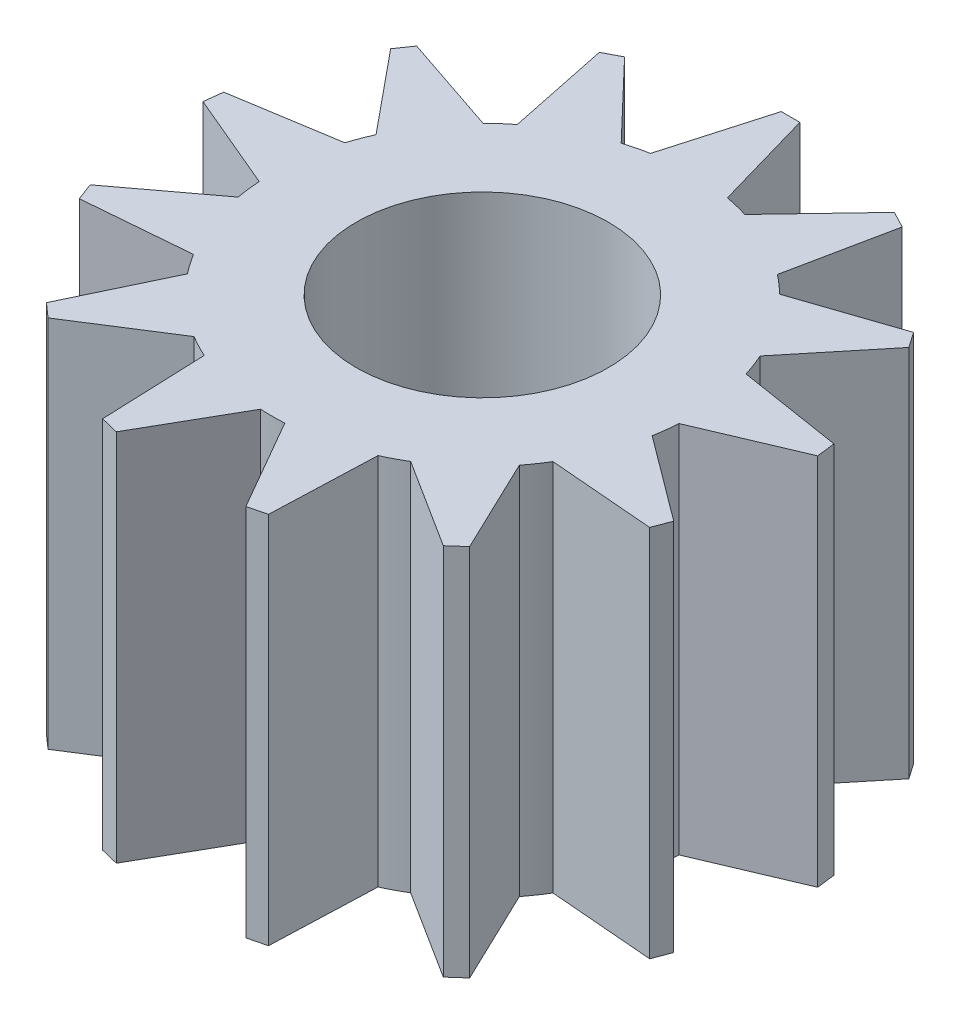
ISO-10303-21;
HEADER;
FILE_DESCRIPTION(('STEP AP214'),'2;1');
FILE_NAME('part.step','',(''),(''),'','','');
FILE_SCHEMA(('AUTOMOTIVE_DESIGN { 1 0 10303 214 1 1 1 1 }'));
ENDSEC;
DATA;
#1=APPLICATION_CONTEXT('core data for automotive mechanical design processes');
#2=APPLICATION_PROTOCOL_DEFINITION('international standard','automotive_design',2000,#1);
#3=PRODUCT_CONTEXT('',#1,'mechanical');
#4=PRODUCT('Part','Part','',(#3));
#5=PRODUCT_RELATED_PRODUCT_CATEGORY('part','',(#4));
#6=PRODUCT_DEFINITION_FORMATION('','',#4);
#7=PRODUCT_DEFINITION_CONTEXT('part definition',#1,'design');
#8=PRODUCT_DEFINITION('design','',#6,#7);
#9=PRODUCT_DEFINITION_SHAPE('','',#8);
#10=(LENGTH_UNIT() NAMED_UNIT(*) SI_UNIT(.MILLI.,.METRE.));
#11=(NAMED_UNIT(*) PLANE_ANGLE_UNIT() SI_UNIT($,.RADIAN.));
#12=(NAMED_UNIT(*) SI_UNIT($,.STERADIAN.) SOLID_ANGLE_UNIT());
#13=UNCERTAINTY_MEASURE_WITH_UNIT(LENGTH_MEASURE(1.E-05),#10,'distance_accuracy_value','');
#14=(GEOMETRIC_REPRESENTATION_CONTEXT(3) GLOBAL_UNCERTAINTY_ASSIGNED_CONTEXT((#13)) GLOBAL_UNIT_ASSIGNED_CONTEXT((#10,
#11,#12)) REPRESENTATION_CONTEXT('',''));
#15=CARTESIAN_POINT('',(0.,0.,0.));
#16=DIRECTION('',(0.,0.,1.));
#17=DIRECTION('',(1.,0.,0.));
#18=AXIS2_PLACEMENT_3D('',#15,#16,#17);
#19=CARTESIAN_POINT('',(-6.51605506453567,8.,-1.57787880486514));
#20=DIRECTION('',(0.,-1.,0.));
#21=DIRECTION('',(0.,0.,-1.));
#22=AXIS2_PLACEMENT_3D('',#19,#20,#21);
#23=CYLINDRICAL_SURFACE('',#22,4.5);
#24=DIRECTION('',(0.,-1.,0.));
#25=VECTOR('',#24,1.);
#26=CARTESIAN_POINT('',(-5.19668637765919,11.0730030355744,-5.88011848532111));
#27=LINE('',#26,#25);
#28=CARTESIAN_POINT('',(-5.19668637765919,8.,-5.88011848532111));
#29=VERTEX_POINT('',#28);
#30=CARTESIAN_POINT('',(-5.19668637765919,0.,-5.88011848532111));
#31=VERTEX_POINT('',#30);
#32=EDGE_CURVE('E385',#29,#31,#27,.T.);
#33=ORIENTED_EDGE('',*,*,#32,.T.);
#34=CARTESIAN_POINT('',(-6.51605506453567,0.,-1.57787880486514));
#35=DIRECTION('',(0.,1.,0.));
#36=DIRECTION('',(0.,0.,1.));
#37=AXIS2_PLACEMENT_3D('',#34,#35,#36);
#38=CIRCLE('',#37,4.5);
#39=CARTESIAN_POINT('',(-5.69207373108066,0.,-6.00179728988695));
#40=VERTEX_POINT('',#39);
#41=EDGE_CURVE('E729',#31,#40,#38,.T.);
#42=ORIENTED_EDGE('',*,*,#41,.T.);
#43=DIRECTION('',(0.,-1.,0.));
#44=VECTOR('',#43,1.);
#45=CARTESIAN_POINT('',(-5.69207373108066,10.7296724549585,-6.00179728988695));
#46=LINE('',#45,#44);
#47=CARTESIAN_POINT('',(-5.69207373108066,8.,-6.00179728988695));
#48=VERTEX_POINT('',#47);
#49=EDGE_CURVE('E713',#48,#40,#46,.T.);
#50=ORIENTED_EDGE('',*,*,#49,.F.);
#51=CARTESIAN_POINT('',(-6.51605506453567,8.,-1.57787880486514));
#52=DIRECTION('',(0.,1.,0.));
#53=DIRECTION('',(0.,0.,1.));
#54=AXIS2_PLACEMENT_3D('',#51,#52,#53);
#55=CIRCLE('',#54,4.5);
#56=EDGE_CURVE('E48',#29,#48,#55,.T.);
#57=ORIENTED_EDGE('',*,*,#56,.F.);
#58=EDGE_LOOP('',(#33,#42,#50,#57));
#59=FACE_BOUND('',#58,.T.);
#60=ADVANCED_FACE('F37',(#59),#23,.T.);
#61=CARTESIAN_POINT('',(-3.34803254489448,0.,-4.7737563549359));
#62=VERTEX_POINT('',#61);
#63=CARTESIAN_POINT('',(-3.7362559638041,0.,-5.11662391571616));
#64=VERTEX_POINT('',#63);
#65=EDGE_CURVE('E732',#62,#64,#38,.T.);
#66=ORIENTED_EDGE('',*,*,#65,.T.);
#67=DIRECTION('',(0.,-1.,0.));
#68=VECTOR('',#67,1.);
#69=CARTESIAN_POINT('',(-3.7362559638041,11.0730030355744,-5.11662391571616));
#70=LINE('',#69,#68);
#71=CARTESIAN_POINT('',(-3.7362559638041,8.,-5.11662391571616));
#72=VERTEX_POINT('',#71);
#73=EDGE_CURVE('E62',#72,#64,#70,.T.);
#74=ORIENTED_EDGE('',*,*,#73,.F.);
#75=CARTESIAN_POINT('',(-3.34803254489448,8.,-4.7737563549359));
#76=VERTEX_POINT('',#75);
#77=EDGE_CURVE('E775',#76,#72,#55,.T.);
#78=ORIENTED_EDGE('',*,*,#77,.F.);
#79=DIRECTION('',(0.,-1.,0.));
#80=VECTOR('',#79,1.);
#81=CARTESIAN_POINT('',(-3.34803254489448,11.1552257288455,-4.7737563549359));
#82=LINE('',#81,#80);
#83=EDGE_CURVE('E387',#76,#62,#82,.T.);
#84=ORIENTED_EDGE('',*,*,#83,.T.);
#85=EDGE_LOOP('',(#66,#74,#78,#84));
#86=FACE_BOUND('',#85,.T.);
#87=ADVANCED_FACE('F866',(#86),#23,.T.);
#88=CARTESIAN_POINT('',(-2.22552986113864,0.,-2.93485834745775));
#89=VERTEX_POINT('',#88);
#90=CARTESIAN_POINT('',(-2.4098811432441,0.,-3.41889366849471));
#91=VERTEX_POINT('',#90);
#92=EDGE_CURVE('E733',#89,#91,#38,.T.);
#93=ORIENTED_EDGE('',*,*,#92,.T.);
#94=DIRECTION('',(0.,-1.,0.));
#95=VECTOR('',#94,1.);
#96=CARTESIAN_POINT('',(-2.4098811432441,11.1552257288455,-3.41889366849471));
#97=LINE('',#96,#95);
#98=CARTESIAN_POINT('',(-2.4098811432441,8.,-3.41889366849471));
#99=VERTEX_POINT('',#98);
#100=EDGE_CURVE('E416',#99,#91,#97,.T.);
#101=ORIENTED_EDGE('',*,*,#100,.F.);
#102=CARTESIAN_POINT('',(-2.22552986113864,8.,-2.93485834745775));
#103=VERTEX_POINT('',#102);
#104=EDGE_CURVE('E771',#103,#99,#55,.T.);
#105=ORIENTED_EDGE('',*,*,#104,.F.);
#106=DIRECTION('',(0.,-1.,0.));
#107=VECTOR('',#106,1.);
#108=CARTESIAN_POINT('',(-2.22552986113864,10.8098196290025,-2.93485834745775));
#109=LINE('',#108,#107);
#110=EDGE_CURVE('E422',#103,#89,#109,.T.);
#111=ORIENTED_EDGE('',*,*,#110,.T.);
#112=EDGE_LOOP('',(#93,#101,#105,#111));
#113=FACE_BOUND('',#112,.T.);
#114=ADVANCED_FACE('F754',(#113),#23,.T.);
#115=CARTESIAN_POINT('',(-2.08647025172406,0.,-0.784923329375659));
#116=VERTEX_POINT('',#115);
#117=CARTESIAN_POINT('',(-2.0246937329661,0.,-1.29917934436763));
#118=VERTEX_POINT('',#117);
#119=EDGE_CURVE('E750',#116,#118,#38,.T.);
#120=ORIENTED_EDGE('',*,*,#119,.T.);
#121=DIRECTION('',(0.,-1.,0.));
#122=VECTOR('',#121,1.);
#123=CARTESIAN_POINT('',(-2.0246937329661,10.8098196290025,-1.29917934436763));
#124=LINE('',#123,#122);
#125=CARTESIAN_POINT('',(-2.0246937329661,8.,-1.29917934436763));
#126=VERTEX_POINT('',#125);
#127=EDGE_CURVE('E443',#126,#118,#124,.T.);
#128=ORIENTED_EDGE('',*,*,#127,.F.);
#129=CARTESIAN_POINT('',(-2.08647025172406,8.,-0.78492332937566));
#130=VERTEX_POINT('',#129);
#131=EDGE_CURVE('E774',#130,#126,#55,.T.);
#132=ORIENTED_EDGE('',*,*,#131,.F.);
#133=DIRECTION('',(0.,-1.,0.));
#134=VECTOR('',#133,1.);
#135=CARTESIAN_POINT('',(-2.08647025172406,10.9548311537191,-0.784923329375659));
#136=LINE('',#135,#134);
#137=EDGE_CURVE('E449',#130,#116,#136,.T.);
#138=ORIENTED_EDGE('',*,*,#137,.T.);
#139=EDGE_LOOP('',(#120,#128,#132,#138));
#140=FACE_BOUND('',#139,.T.);
#141=ADVANCED_FACE('F847',(#140),#23,.T.);
#142=CARTESIAN_POINT('',(-2.96272795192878,0.,1.18325618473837));
#143=VERTEX_POINT('',#142);
#144=CARTESIAN_POINT('',(-2.66898359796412,0.,0.756653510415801));
#145=VERTEX_POINT('',#144);
#146=EDGE_CURVE('E748',#143,#145,#38,.T.);
#147=ORIENTED_EDGE('',*,*,#146,.T.);
#148=DIRECTION('',(0.,-1.,0.));
#149=VECTOR('',#148,1.);
#150=CARTESIAN_POINT('',(-2.66898359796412,10.9548311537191,0.756653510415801));
#151=LINE('',#150,#149);
#152=CARTESIAN_POINT('',(-2.66898359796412,8.,0.756653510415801));
#153=VERTEX_POINT('',#152);
#154=EDGE_CURVE('E470',#153,#145,#151,.T.);
#155=ORIENTED_EDGE('',*,*,#154,.F.);
#156=CARTESIAN_POINT('',(-2.96272795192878,8.,1.18325618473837));
#157=VERTEX_POINT('',#156);
#158=EDGE_CURVE('E777',#157,#153,#55,.T.);
#159=ORIENTED_EDGE('',*,*,#158,.F.);
#160=DIRECTION('',(0.,-1.,0.));
#161=VECTOR('',#160,1.);
#162=CARTESIAN_POINT('',(-2.96272795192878,11.1951608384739,1.18325618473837));
#163=LINE('',#162,#161);
#164=EDGE_CURVE('E476',#157,#143,#163,.T.);
#165=ORIENTED_EDGE('',*,*,#164,.T.);
#166=EDGE_LOOP('',(#147,#155,#159,#165));
#167=FACE_BOUND('',#166,.T.);
#168=ADVANCED_FACE('F904',(#167),#23,.T.);
#169=CARTESIAN_POINT('',(-4.65345352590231,0.,2.51854835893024));
#170=VERTEX_POINT('',#169);
#171=CARTESIAN_POINT('',(-4.19507128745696,0.,2.27738179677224));
#172=VERTEX_POINT('',#171);
#173=EDGE_CURVE('E746',#170,#172,#38,.T.);
#174=ORIENTED_EDGE('',*,*,#173,.T.);
#175=DIRECTION('',(0.,-1.,0.));
#176=VECTOR('',#175,1.);
#177=CARTESIAN_POINT('',(-4.19507128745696,11.1951608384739,2.27738179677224));
#178=LINE('',#177,#176);
#179=CARTESIAN_POINT('',(-4.19507128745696,8.,2.27738179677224));
#180=VERTEX_POINT('',#179);
#181=EDGE_CURVE('E497',#180,#172,#178,.T.);
#182=ORIENTED_EDGE('',*,*,#181,.F.);
#183=CARTESIAN_POINT('',(-4.65345352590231,8.,2.51854835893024));
#184=VERTEX_POINT('',#183);
#185=EDGE_CURVE('E824',#184,#180,#55,.T.);
#186=ORIENTED_EDGE('',*,*,#185,.F.);
#187=DIRECTION('',(0.,-1.,0.));
#188=VECTOR('',#187,1.);
#189=CARTESIAN_POINT('',(-4.65345352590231,10.8497115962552,2.51854835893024));
#190=LINE('',#189,#188);
#191=EDGE_CURVE('E503',#184,#170,#190,.T.);
#192=ORIENTED_EDGE('',*,*,#191,.T.);
#193=EDGE_LOOP('',(#174,#182,#186,#192));
#194=FACE_BOUND('',#193,.T.);
#195=ADVANCED_FACE('F900',(#194),#23,.T.);
#196=CARTESIAN_POINT('',(-6.77111111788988,0.,2.91488720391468));
#197=VERTEX_POINT('',#196);
#198=CARTESIAN_POINT('',(-6.25315804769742,0.,2.91443520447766));
#199=VERTEX_POINT('',#198);
#200=EDGE_CURVE('E744',#197,#199,#38,.T.);
#201=ORIENTED_EDGE('',*,*,#200,.T.);
#202=DIRECTION('',(0.,-1.,0.));
#203=VECTOR('',#202,1.);
#204=CARTESIAN_POINT('',(-6.25315804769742,10.8497115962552,2.91443520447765));
#205=LINE('',#204,#203);
#206=CARTESIAN_POINT('',(-6.25315804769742,8.,2.91443520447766));
#207=VERTEX_POINT('',#206);
#208=EDGE_CURVE('E524',#207,#199,#205,.T.);
#209=ORIENTED_EDGE('',*,*,#208,.F.);
#210=CARTESIAN_POINT('',(-6.77111111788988,8.,2.91488720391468));
#211=VERTEX_POINT('',#210);
#212=EDGE_CURVE('E821',#211,#207,#55,.T.);
#213=ORIENTED_EDGE('',*,*,#212,.F.);
#214=DIRECTION('',(0.,-1.,0.));
#215=VECTOR('',#214,1.);
#216=CARTESIAN_POINT('',(-6.77111111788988,10.849414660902,2.91488720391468));
#217=LINE('',#216,#215);
#218=EDGE_CURVE('E530',#211,#197,#217,.T.);
#219=ORIENTED_EDGE('',*,*,#218,.T.);
#220=EDGE_LOOP('',(#201,#209,#213,#219));
#221=FACE_BOUND('',#220,.T.);
#222=ADVANCED_FACE('F896',(#221),#23,.T.);
#223=CARTESIAN_POINT('',(-8.83030661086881,0.,2.281426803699));
#224=VERTEX_POINT('',#223);
#225=CARTESIAN_POINT('',(-8.37150415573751,0.,2.52179297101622));
#226=VERTEX_POINT('',#225);
#227=EDGE_CURVE('E742',#224,#226,#38,.T.);
#228=ORIENTED_EDGE('',*,*,#227,.T.);
#229=DIRECTION('',(0.,-1.,0.));
#230=VECTOR('',#229,1.);
#231=CARTESIAN_POINT('',(-8.37150415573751,10.849414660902,2.52179297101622));
#232=LINE('',#231,#230);
#233=CARTESIAN_POINT('',(-8.37150415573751,8.,2.52179297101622));
#234=VERTEX_POINT('',#233);
#235=EDGE_CURVE('E551',#234,#226,#232,.T.);
#236=ORIENTED_EDGE('',*,*,#235,.F.);
#237=CARTESIAN_POINT('',(-8.83030661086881,8.,2.281426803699));
#238=VERTEX_POINT('',#237);
#239=EDGE_CURVE('E818',#238,#234,#55,.T.);
#240=ORIENTED_EDGE('',*,*,#239,.F.);
#241=DIRECTION('',(0.,-1.,0.));
#242=VECTOR('',#241,1.);
#243=CARTESIAN_POINT('',(-8.83030661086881,11.1948683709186,2.281426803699));
#244=LINE('',#243,#242);
#245=EDGE_CURVE('E557',#238,#224,#244,.T.);
#246=ORIENTED_EDGE('',*,*,#245,.T.);
#247=EDGE_LOOP('',(#228,#236,#240,#246));
#248=FACE_BOUND('',#247,.T.);
#249=ADVANCED_FACE('F892',(#248),#23,.T.);
#250=CARTESIAN_POINT('',(-10.3590461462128,0.,0.763364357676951));
#251=VERTEX_POINT('',#250);
#252=CARTESIAN_POINT('',(-10.0645576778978,0.,1.18945370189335));
#253=VERTEX_POINT('',#252);
#254=EDGE_CURVE('E740',#251,#253,#38,.T.);
#255=ORIENTED_EDGE('',*,*,#254,.T.);
#256=DIRECTION('',(0.,-1.,0.));
#257=VECTOR('',#256,1.);
#258=CARTESIAN_POINT('',(-10.0645576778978,11.1948683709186,1.18945370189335));
#259=LINE('',#258,#257);
#260=CARTESIAN_POINT('',(-10.0645576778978,8.,1.18945370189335));
#261=VERTEX_POINT('',#260);
#262=EDGE_CURVE('E578',#261,#253,#259,.T.);
#263=ORIENTED_EDGE('',*,*,#262,.F.);
#264=CARTESIAN_POINT('',(-10.3590461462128,8.,0.763364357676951));
#265=VERTEX_POINT('',#264);
#266=EDGE_CURVE('E815',#265,#261,#55,.T.);
#267=ORIENTED_EDGE('',*,*,#266,.F.);
#268=DIRECTION('',(0.,-1.,0.));
#269=VECTOR('',#268,1.);
#270=CARTESIAN_POINT('',(-10.3590461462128,10.9568020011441,0.763364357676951));
#271=LINE('',#270,#269);
#272=EDGE_CURVE('E584',#265,#251,#271,.T.);
#273=ORIENTED_EDGE('',*,*,#272,.T.);
#274=EDGE_LOOP('',(#255,#263,#267,#273));
#275=FACE_BOUND('',#274,.T.);
#276=ADVANCED_FACE('F888',(#275),#23,.T.);
#277=CARTESIAN_POINT('',(-11.0069231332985,0.,-1.29134086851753));
#278=VERTEX_POINT('',#277);
#279=CARTESIAN_POINT('',(-10.9442491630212,0.,-0.777193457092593));
#280=VERTEX_POINT('',#279);
#281=EDGE_CURVE('E738',#278,#280,#38,.T.);
#282=ORIENTED_EDGE('',*,*,#281,.T.);
#283=DIRECTION('',(0.,-1.,0.));
#284=VECTOR('',#283,1.);
#285=CARTESIAN_POINT('',(-10.9442491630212,10.9568020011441,-0.777193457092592));
#286=LINE('',#285,#284);
#287=CARTESIAN_POINT('',(-10.9442491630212,8.,-0.777193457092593));
#288=VERTEX_POINT('',#287);
#289=EDGE_CURVE('E605',#288,#280,#286,.T.);
#290=ORIENTED_EDGE('',*,*,#289,.F.);
#291=CARTESIAN_POINT('',(-11.0069231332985,8.,-1.29134086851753));
#292=VERTEX_POINT('',#291);
#293=EDGE_CURVE('E812',#292,#288,#55,.T.);
#294=ORIENTED_EDGE('',*,*,#293,.F.);
#295=DIRECTION('',(0.,-1.,0.));
#296=VECTOR('',#295,1.);
#297=CARTESIAN_POINT('',(-11.0069231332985,10.8089536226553,-1.29134086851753));
#298=LINE('',#297,#296);
#299=EDGE_CURVE('E611',#292,#278,#298,.T.);
#300=ORIENTED_EDGE('',*,*,#299,.T.);
#301=EDGE_LOOP('',(#282,#290,#294,#300));
#302=FACE_BOUND('',#301,.T.);
#303=ADVANCED_FACE('F884',(#302),#23,.T.);
#304=CARTESIAN_POINT('',(-10.6254359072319,0.,-3.41172424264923));
#305=VERTEX_POINT('',#304);
#306=CARTESIAN_POINT('',(-10.8089421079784,0.,-2.92736790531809));
#307=VERTEX_POINT('',#306);
#308=EDGE_CURVE('E736',#305,#307,#38,.T.);
#309=ORIENTED_EDGE('',*,*,#308,.T.);
#310=DIRECTION('',(0.,-1.,0.));
#311=VECTOR('',#310,1.);
#312=CARTESIAN_POINT('',(-10.8089421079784,10.8089536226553,-2.92736790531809));
#313=LINE('',#312,#311);
#314=CARTESIAN_POINT('',(-10.8089421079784,8.,-2.92736790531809));
#315=VERTEX_POINT('',#314);
#316=EDGE_CURVE('E632',#315,#307,#313,.T.);
#317=ORIENTED_EDGE('',*,*,#316,.F.);
#318=CARTESIAN_POINT('',(-10.6254359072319,8.,-3.41172424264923));
#319=VERTEX_POINT('',#318);
#320=EDGE_CURVE('E810',#319,#315,#55,.T.);
#321=ORIENTED_EDGE('',*,*,#320,.F.);
#322=DIRECTION('',(0.,-1.,0.));
#323=VECTOR('',#322,1.);
#324=CARTESIAN_POINT('',(-10.6254359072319,11.1543542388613,-3.41172424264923));
#325=LINE('',#324,#323);
#326=EDGE_CURVE('E638',#319,#305,#325,.T.);
#327=ORIENTED_EDGE('',*,*,#326,.T.);
#328=EDGE_LOOP('',(#309,#317,#321,#327));
#329=FACE_BOUND('',#328,.T.);
#330=ADVANCED_FACE('F880',(#329),#23,.T.);
#331=CARTESIAN_POINT('',(-9.30202620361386,0.,-5.11176686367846));
#332=VERTEX_POINT('',#331);
#333=CARTESIAN_POINT('',(-9.68965061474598,0.,-4.76822224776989));
#334=VERTEX_POINT('',#333);
#335=EDGE_CURVE('E734',#332,#334,#38,.T.);
#336=ORIENTED_EDGE('',*,*,#335,.T.);
#337=DIRECTION('',(0.,-1.,0.));
#338=VECTOR('',#337,1.);
#339=CARTESIAN_POINT('',(-9.68965061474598,11.1543542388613,-4.76822224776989));
#340=LINE('',#339,#338);
#341=CARTESIAN_POINT('',(-9.68965061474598,8.,-4.76822224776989));
#342=VERTEX_POINT('',#341);
#343=EDGE_CURVE('E659',#342,#334,#340,.T.);
#344=ORIENTED_EDGE('',*,*,#343,.F.);
#345=CARTESIAN_POINT('',(-9.30202620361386,8.,-5.11176686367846));
#346=VERTEX_POINT('',#345);
#347=EDGE_CURVE('E46',#346,#342,#55,.T.);
#348=ORIENTED_EDGE('',*,*,#347,.F.);
#349=DIRECTION('',(0.,-1.,0.));
#350=VECTOR('',#349,1.);
#351=CARTESIAN_POINT('',(-9.30202620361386,11.074443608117,-5.11176686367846));
#352=LINE('',#351,#350);
#353=EDGE_CURVE('E665',#346,#332,#352,.T.);
#354=ORIENTED_EDGE('',*,*,#353,.T.);
#355=EDGE_LOOP('',(#336,#344,#348,#354));
#356=FACE_BOUND('',#355,.T.);
#357=ADVANCED_FACE('F809',(#356),#23,.T.);
#358=CARTESIAN_POINT('',(-6.51605506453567,8.,-1.57787880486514));
#359=DIRECTION('',(0.,-1.,0.));
#360=DIRECTION('',(0.,0.,-1.));
#361=AXIS2_PLACEMENT_3D('',#358,#359,#360);
#362=CYLINDRICAL_SURFACE('',#361,2.7);
#363=CARTESIAN_POINT('',(-6.51605506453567,8.,-1.57787880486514));
#364=DIRECTION('',(0.,1.,0.));
#365=DIRECTION('',(0.,0.,1.));
#366=AXIS2_PLACEMENT_3D('',#363,#364,#365);
#367=CIRCLE('',#366,2.7);
#368=CARTESIAN_POINT('',(-6.51605506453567,8.,1.12212119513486));
#369=VERTEX_POINT('',#368);
#370=EDGE_CURVE('E726',#369,#369,#367,.T.);
#371=ORIENTED_EDGE('',*,*,#370,.T.);
#372=EDGE_LOOP('',(#371));
#373=FACE_BOUND('',#372,.T.);
#374=CARTESIAN_POINT('',(-6.51605506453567,0.,-1.57787880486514));
#375=DIRECTION('',(0.,1.,0.));
#376=DIRECTION('',(0.,0.,1.));
#377=AXIS2_PLACEMENT_3D('',#374,#375,#376);
#378=CIRCLE('',#377,2.7);
#379=CARTESIAN_POINT('',(-6.51605506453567,0.,1.12212119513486));
#380=VERTEX_POINT('',#379);
#381=EDGE_CURVE('E719',#380,#380,#378,.T.);
#382=ORIENTED_EDGE('',*,*,#381,.F.);
#383=EDGE_LOOP('',(#382));
#384=FACE_BOUND('',#383,.T.);
#385=ADVANCED_FACE('F39',(#373,#384),#362,.F.);
#386=CARTESIAN_POINT('',(-7.34003639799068,0.,-6.00179728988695));
#387=VERTEX_POINT('',#386);
#388=CARTESIAN_POINT('',(-7.84293056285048,0.,-5.87780920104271));
#389=VERTEX_POINT('',#388);
#390=EDGE_CURVE('E41',#387,#389,#38,.T.);
#391=ORIENTED_EDGE('',*,*,#390,.T.);
#392=DIRECTION('',(0.,-1.,0.));
#393=VECTOR('',#392,1.);
#394=CARTESIAN_POINT('',(-7.84293056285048,11.074443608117,-5.87780920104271));
#395=LINE('',#394,#393);
#396=CARTESIAN_POINT('',(-7.84293056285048,8.,-5.87780920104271));
#397=VERTEX_POINT('',#396);
#398=EDGE_CURVE('E686',#397,#389,#395,.T.);
#399=ORIENTED_EDGE('',*,*,#398,.F.);
#400=CARTESIAN_POINT('',(-7.34003639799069,8.,-6.00179728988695));
#401=VERTEX_POINT('',#400);
#402=EDGE_CURVE('E11',#401,#397,#55,.T.);
#403=ORIENTED_EDGE('',*,*,#402,.F.);
#404=DIRECTION('',(0.,-1.,0.));
#405=VECTOR('',#404,1.);
#406=CARTESIAN_POINT('',(-7.34003639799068,10.7296724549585,-6.00179728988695));
#407=LINE('',#406,#405);
#408=EDGE_CURVE('E692',#401,#387,#407,.T.);
#409=ORIENTED_EDGE('',*,*,#408,.T.);
#410=EDGE_LOOP('',(#391,#399,#403,#409));
#411=FACE_BOUND('',#410,.T.);
#412=ADVANCED_FACE('F793',(#411),#23,.T.);
#413=CARTESIAN_POINT('',(0.,8.,0.));
#414=DIRECTION('',(0.,1.,0.));
#415=DIRECTION('',(0.,0.,1.));
#416=AXIS2_PLACEMENT_3D('',#413,#414,#415);
#417=PLANE('',#416);
#418=ORIENTED_EDGE('',*,*,#370,.F.);
#419=EDGE_LOOP('',(#418));
#420=FACE_BOUND('',#419,.T.);
#421=ORIENTED_EDGE('',*,*,#402,.T.);
#422=DIRECTION('',(0.690882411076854,0.,0.722967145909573));
#423=VECTOR('',#422,1.);
#424=CARTESIAN_POINT('',(-2.7730654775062,8.,-0.572498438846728));
#425=LINE('',#424,#423);
#426=CARTESIAN_POINT('',(-9.40693384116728,8.,-7.51444514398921));
#427=VERTEX_POINT('',#426);
#428=EDGE_CURVE('E687',#427,#397,#425,.T.);
#429=ORIENTED_EDGE('',*,*,#428,.F.);
#430=DIRECTION('',(0.885393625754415,0.,-0.464842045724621));
#431=VECTOR('',#430,1.);
#432=CARTESIAN_POINT('',(-3.81473894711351,8.,-10.4504131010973));
#433=LINE('',#432,#431);
#434=CARTESIAN_POINT('',(-9.76109129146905,8.,-7.32850832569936));
#435=VERTEX_POINT('',#434);
#436=EDGE_CURVE('E683',#435,#427,#433,.T.);
#437=ORIENTED_EDGE('',*,*,#436,.F.);
#438=DIRECTION('',(0.20278729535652,0.,0.979222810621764));
#439=VECTOR('',#438,1.);
#440=CARTESIAN_POINT('',(-8.54236276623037,8.,-1.44349087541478));
#441=LINE('',#440,#439);
#442=EDGE_CURVE('E682',#435,#346,#441,.T.);
#443=ORIENTED_EDGE('',*,*,#442,.T.);
#444=ORIENTED_EDGE('',*,*,#347,.T.);
#445=DIRECTION('',(0.947768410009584,0.,0.318959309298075));
#446=VECTOR('',#445,1.);
#447=CARTESIAN_POINT('',(-2.73469287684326,8.,-2.42762037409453));
#448=LINE('',#447,#446);
#449=CARTESIAN_POINT('',(-11.8351863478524,8.,-5.49027479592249));
#450=VERTEX_POINT('',#449);
#451=EDGE_CURVE('E660',#450,#342,#448,.T.);
#452=ORIENTED_EDGE('',*,*,#451,.F.);
#453=DIRECTION('',(0.5678437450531,0.,-0.823136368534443));
#454=VECTOR('',#453,1.);
#455=CARTESIAN_POINT('',(-8.24865398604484,8.,-10.689249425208));
#456=LINE('',#455,#454);
#457=CARTESIAN_POINT('',(-12.0623238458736,8.,-5.16102024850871));
#458=VERTEX_POINT('',#457);
#459=EDGE_CURVE('E656',#458,#450,#456,.T.);
#460=ORIENTED_EDGE('',*,*,#459,.F.);
#461=DIRECTION('',(0.634730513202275,0.,0.772733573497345));
#462=VECTOR('',#461,1.);
#463=CARTESIAN_POINT('',(-8.24766582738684,8.,-0.516979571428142));
#464=LINE('',#463,#462);
#465=EDGE_CURVE('E655',#458,#319,#464,.T.);
#466=ORIENTED_EDGE('',*,*,#465,.T.);
#467=ORIENTED_EDGE('',*,*,#320,.T.);
#468=DIRECTION('',(0.987413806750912,0.,-0.158158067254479));
#469=VECTOR('',#468,1.);
#470=CARTESIAN_POINT('',(-3.56305669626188,8.,-4.08797070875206));
#471=LINE('',#470,#469);
#472=CARTESIAN_POINT('',(-13.0442261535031,8.,-2.56933340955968));
#473=VERTEX_POINT('',#472);
#474=EDGE_CURVE('E633',#473,#315,#471,.T.);
#475=ORIENTED_EDGE('',*,*,#474,.F.);
#476=DIRECTION('',(0.120136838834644,0.,-0.992757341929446));
#477=VECTOR('',#476,1.);
#478=CARTESIAN_POINT('',(-12.2854352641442,8.,-8.83964344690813));
#479=LINE('',#478,#477);
#480=CARTESIAN_POINT('',(-13.0922808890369,8.,-2.1722304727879));
#481=VERTEX_POINT('',#480);
#482=EDGE_CURVE('E629',#481,#473,#479,.T.);
#483=ORIENTED_EDGE('',*,*,#482,.F.);
#484=DIRECTION('',(0.921185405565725,0.,0.389123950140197));
#485=VECTOR('',#484,1.);
#486=CARTESIAN_POINT('',(-7.5560616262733,8.,0.166360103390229));
#487=LINE('',#486,#485);
#488=EDGE_CURVE('E628',#481,#292,#487,.T.);
#489=ORIENTED_EDGE('',*,*,#488,.T.);
#490=ORIENTED_EDGE('',*,*,#293,.T.);
#491=DIRECTION('',(0.800731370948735,0.,-0.599023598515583));
#492=VECTOR('',#491,1.);
#493=CARTESIAN_POINT('',(-5.06828538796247,8.,-5.17297597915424));
#494=LINE('',#493,#492);
#495=CARTESIAN_POINT('',(-12.756925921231,8.,0.578862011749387));
#496=VERTEX_POINT('',#495);
#497=EDGE_CURVE('E606',#496,#288,#494,.T.);
#498=ORIENTED_EDGE('',*,*,#497,.F.);
#499=DIRECTION('',(-0.355106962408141,0.,-0.934825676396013));
#500=VECTOR('',#499,1.);
#501=CARTESIAN_POINT('',(-14.9998010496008,8.,-5.32554843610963));
#502=LINE('',#501,#500);
#503=CARTESIAN_POINT('',(-12.6148831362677,8.,0.952792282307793));
#504=VERTEX_POINT('',#503);
#505=EDGE_CURVE('E602',#504,#496,#502,.T.);
#506=ORIENTED_EDGE('',*,*,#505,.F.);
#507=DIRECTION('',(0.996492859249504,0.,-0.0836778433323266));
#508=VECTOR('',#507,1.);
#509=CARTESIAN_POINT('',(-6.62607466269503,8.,0.449897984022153));
#510=LINE('',#509,#508);
#511=EDGE_CURVE('E601',#504,#265,#510,.T.);
#512=ORIENTED_EDGE('',*,*,#511,.T.);
#513=ORIENTED_EDGE('',*,*,#266,.T.);
#514=DIRECTION('',(0.430511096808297,0.,-0.90258528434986));
#515=VECTOR('',#514,1.);
#516=CARTESIAN_POINT('',(-6.90536134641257,8.,-5.43393914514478));
#517=LINE('',#516,#515);
#518=CARTESIAN_POINT('',(-11.0391385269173,8.,3.23270494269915));
#519=VERTEX_POINT('',#518);
#520=EDGE_CURVE('E579',#519,#261,#517,.T.);
#521=ORIENTED_EDGE('',*,*,#520,.F.);
#522=DIRECTION('',(-0.748955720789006,0.,-0.662620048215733));
#523=VECTOR('',#522,1.);
#524=CARTESIAN_POINT('',(-15.7695841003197,8.,-0.9524397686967));
#525=LINE('',#524,#523);
#526=CARTESIAN_POINT('',(-10.7395562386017,8.,3.49775296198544));
#527=VERTEX_POINT('',#526);
#528=EDGE_CURVE('E575',#527,#519,#525,.T.);
#529=ORIENTED_EDGE('',*,*,#528,.F.);
#530=DIRECTION('',(0.843391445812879,0.,-0.537299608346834));
#531=VECTOR('',#530,1.);
#532=CARTESIAN_POINT('',(-5.67086980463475,8.,0.268643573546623));
#533=LINE('',#532,#531);
#534=EDGE_CURVE('E574',#527,#238,#533,.T.);
#535=ORIENTED_EDGE('',*,*,#534,.T.);
#536=ORIENTED_EDGE('',*,*,#239,.T.);
#537=DIRECTION('',(-0.038387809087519,0.,-0.999262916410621));
#538=VECTOR('',#537,1.);
#539=CARTESIAN_POINT('',(-8.65320334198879,8.,-4.81104412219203));
#540=LINE('',#539,#538);
#541=CARTESIAN_POINT('',(-8.28460274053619,8.,4.78390075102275));
#542=VERTEX_POINT('',#541);
#543=EDGE_CURVE('E552',#542,#234,#540,.T.);
#544=ORIENTED_EDGE('',*,*,#543,.F.);
#545=DIRECTION('',(-0.971134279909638,0.,-0.238533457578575));
#546=VECTOR('',#545,1.);
#547=CARTESIAN_POINT('',(-14.4183403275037,8.,3.27731029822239));
#548=LINE('',#547,#546);
#549=CARTESIAN_POINT('',(-7.89614902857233,8.,4.87931413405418));
#550=VERTEX_POINT('',#549);
#551=EDGE_CURVE('E548',#550,#542,#548,.T.);
#552=ORIENTED_EDGE('',*,*,#551,.F.);
#553=DIRECTION('',(0.496973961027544,0.,-0.867765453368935));
#554=VECTOR('',#553,1.);
#555=CARTESIAN_POINT('',(-4.90939218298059,8.,-0.33585730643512));
#556=LINE('',#555,#554);
#557=EDGE_CURVE('E547',#550,#211,#556,.T.);
#558=ORIENTED_EDGE('',*,*,#557,.T.);
#559=ORIENTED_EDGE('',*,*,#212,.T.);
#560=DIRECTION('',(-0.49848773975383,0.,-0.866896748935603));
#561=VECTOR('',#560,1.);
#562=CARTESIAN_POINT('',(-9.91118370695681,8.,-3.44706639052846));
#563=LINE('',#562,#561);
#564=CARTESIAN_POINT('',(-5.12469328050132,8.,4.87689558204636));
#565=VERTEX_POINT('',#564);
#566=EDGE_CURVE('E525',#565,#207,#563,.T.);
#567=ORIENTED_EDGE('',*,*,#566,.F.);
#568=DIRECTION('',(-0.970716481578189,0.,0.240228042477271));
#569=VECTOR('',#568,1.);
#570=CARTESIAN_POINT('',(-11.2557920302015,8.,6.39418912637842));
#571=LINE('',#570,#569);
#572=CARTESIAN_POINT('',(-4.73640668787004,8.,4.78080436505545));
#573=VERTEX_POINT('',#572);
#574=EDGE_CURVE('E521',#573,#565,#571,.T.);
#575=ORIENTED_EDGE('',*,*,#574,.F.);
#576=DIRECTION('',(0.0366437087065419,0.,-0.999328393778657));
#577=VECTOR('',#576,1.);
#578=CARTESIAN_POINT('',(-4.51618217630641,8.,-1.22504534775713));
#579=LINE('',#578,#577);
#580=EDGE_CURVE('E520',#573,#184,#579,.T.);
#581=ORIENTED_EDGE('',*,*,#580,.T.);
#582=ORIENTED_EDGE('',*,*,#185,.T.);
#583=DIRECTION('',(-0.844327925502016,0.,-0.535826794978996));
#584=VECTOR('',#583,1.);
#585=CARTESIAN_POINT('',(-10.3909573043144,8.,-1.65464703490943));
#586=LINE('',#585,#584);
#587=CARTESIAN_POINT('',(-2.28370167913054,8.,3.49037383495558));
#588=VERTEX_POINT('',#587);
#589=EDGE_CURVE('E498',#588,#180,#586,.T.);
#590=ORIENTED_EDGE('',*,*,#589,.F.);
#591=DIRECTION('',(-0.747798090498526,0.,0.663926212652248));
#592=VECTOR('',#591,1.);
#593=CARTESIAN_POINT('',(-7.00683559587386,8.,7.6837683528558));
#594=LINE('',#593,#592);
#595=CARTESIAN_POINT('',(-1.98458244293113,8.,3.22480334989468));
#596=VERTEX_POINT('',#595);
#597=EDGE_CURVE('E494',#596,#588,#594,.T.);
#598=ORIENTED_EDGE('',*,*,#597,.F.);
#599=DIRECTION('',(-0.432085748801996,0.,-0.901832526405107));
#600=VECTOR('',#599,1.);
#601=CARTESIAN_POINT('',(-4.58136853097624,8.,-2.19510731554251));
#602=LINE('',#601,#600);
#603=EDGE_CURVE('E493',#596,#157,#602,.T.);
#604=ORIENTED_EDGE('',*,*,#603,.T.);
#605=ORIENTED_EDGE('',*,*,#158,.T.);
#606=DIRECTION('',(-0.996637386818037,0.,-0.0819385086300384));
#607=VECTOR('',#606,1.);
#608=CARTESIAN_POINT('',(-9.9825539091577,8.,0.155368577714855));
#609=LINE('',#608,#607);
#610=CARTESIAN_POINT('',(-0.41281942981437,8.,0.942143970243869));
#611=VERTEX_POINT('',#610);
#612=EDGE_CURVE('E471',#611,#153,#609,.T.);
#613=ORIENTED_EDGE('',*,*,#612,.F.);
#614=DIRECTION('',(-0.353474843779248,0.,0.935444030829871));
#615=VECTOR('',#614,1.);
#616=CARTESIAN_POINT('',(-2.64538600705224,8.,6.85045997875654));
#617=LINE('',#616,#615);
#618=CARTESIAN_POINT('',(-0.271429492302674,8.,0.567966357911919));
#619=VERTEX_POINT('',#618);
#620=EDGE_CURVE('E467',#619,#611,#617,.T.);
#621=ORIENTED_EDGE('',*,*,#620,.F.);
#622=DIRECTION('',(-0.801775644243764,0.,-0.597625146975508));
#623=VECTOR('',#622,1.);
#624=CARTESIAN_POINT('',(-5.09000970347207,8.,-3.02369263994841));
#625=LINE('',#624,#623);
#626=EDGE_CURVE('E466',#619,#130,#625,.T.);
#627=ORIENTED_EDGE('',*,*,#626,.T.);
#628=ORIENTED_EDGE('',*,*,#131,.T.);
#629=DIRECTION('',(-0.920504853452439,0.,0.390731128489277));
#630=VECTOR('',#629,1.);
#631=CARTESIAN_POINT('',(-8.77958478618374,8.,1.56810179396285));
#632=LINE('',#631,#630);
#633=CARTESIAN_POINT('',(0.0591234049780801,8.,-2.18370724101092));
#634=VERTEX_POINT('',#633);
#635=EDGE_CURVE('E444',#634,#126,#632,.T.);
#636=ORIENTED_EDGE('',*,*,#635,.F.);
#637=DIRECTION('',(0.121869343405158,0.,0.992546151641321));
#638=VECTOR('',#637,1.);
#639=CARTESIAN_POINT('',(0.828856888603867,8.,4.08526890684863));
#640=LINE('',#639,#638);
#641=CARTESIAN_POINT('',(0.0103756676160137,8.,-2.58072570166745));
#642=VERTEX_POINT('',#641);
#643=EDGE_CURVE('E440',#642,#634,#640,.T.);
#644=ORIENTED_EDGE('',*,*,#643,.F.);
#645=DIRECTION('',(-0.987688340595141,0.,-0.156434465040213));
#646=VECTOR('',#645,1.);
#647=CARTESIAN_POINT('',(-5.92551865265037,8.,-3.52087900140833));
#648=LINE('',#647,#646);
#649=EDGE_CURVE('E439',#642,#103,#648,.T.);
#650=ORIENTED_EDGE('',*,*,#649,.T.);
#651=ORIENTED_EDGE('',*,*,#104,.T.);
#652=DIRECTION('',(-0.633380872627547,0.,0.773840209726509));
#653=VECTOR('',#652,1.);
#654=CARTESIAN_POINT('',(-7.05778579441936,8.,2.25973615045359));
#655=LINE('',#654,#653);
#656=CARTESIAN_POINT('',(-0.976048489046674,8.,-5.17069485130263));
#657=VERTEX_POINT('',#656);
#658=EDGE_CURVE('E417',#657,#99,#655,.T.);
#659=ORIENTED_EDGE('',*,*,#658,.F.);
#660=DIRECTION('',(0.569279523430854,0.,0.822144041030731));
#661=VECTOR('',#660,1.);
#662=CARTESIAN_POINT('',(2.61955232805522,8.,0.0220121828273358));
#663=LINE('',#662,#661);
#664=CARTESIAN_POINT('',(-1.20376029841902,8.,-5.49955246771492));
#665=VERTEX_POINT('',#664);
#666=EDGE_CURVE('E413',#665,#657,#663,.T.);
#667=ORIENTED_EDGE('',*,*,#666,.F.);
#668=DIRECTION('',(-0.947210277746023,0.,0.320612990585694));
#669=VECTOR('',#668,1.);
#670=CARTESIAN_POINT('',(-6.89638607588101,8.,-3.57270494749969));
#671=LINE('',#670,#669);
#672=EDGE_CURVE('E412',#665,#76,#671,.T.);
#673=ORIENTED_EDGE('',*,*,#672,.T.);
#674=ORIENTED_EDGE('',*,*,#77,.T.);
#675=DIRECTION('',(-0.201077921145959,0.,0.979575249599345));
#676=VECTOR('',#675,1.);
#677=CARTESIAN_POINT('',(-5.21181521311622,8.,2.07174023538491));
#678=LINE('',#677,#676);
#679=CARTESIAN_POINT('',(-3.28106051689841,8.,-7.33416322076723));
#680=VERTEX_POINT('',#679);
#681=EDGE_CURVE('E393',#680,#72,#678,.T.);
#682=ORIENTED_EDGE('',*,*,#681,.F.);
#683=DIRECTION('',(0.886203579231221,0.,0.46329603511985));
#684=VECTOR('',#683,1.);
#685=CARTESIAN_POINT('',(2.31625008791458,8.,-4.4079599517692));
#686=LINE('',#685,#684);
#687=CARTESIAN_POINT('',(-3.6355419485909,8.,-7.51948163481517));
#688=VERTEX_POINT('',#687);
#689=EDGE_CURVE('E372',#688,#680,#686,.T.);
#690=ORIENTED_EDGE('',*,*,#689,.F.);
#691=DIRECTION('',(-0.689619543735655,0.,0.724171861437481));
#692=VECTOR('',#691,1.);
#693=CARTESIAN_POINT('',(-7.78007678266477,8.,-3.16729131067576));
#694=LINE('',#693,#692);
#695=EDGE_CURVE('E383',#688,#29,#694,.T.);
#696=ORIENTED_EDGE('',*,*,#695,.T.);
#697=ORIENTED_EDGE('',*,*,#56,.T.);
#698=DIRECTION('',(0.275637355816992,0.,0.961261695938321));
#699=VECTOR('',#698,1.);
#700=CARTESIAN_POINT('',(-3.669379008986,8.,1.05217749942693));
#701=LINE('',#700,#699);
#702=CARTESIAN_POINT('',(-6.31605506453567,8.,-8.17787880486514));
#703=VERTEX_POINT('',#702);
#704=EDGE_CURVE('E714',#703,#48,#701,.T.);
#705=ORIENTED_EDGE('',*,*,#704,.F.);
#706=DIRECTION('',(1.,0.,0.));
#707=VECTOR('',#706,1.);
#708=CARTESIAN_POINT('',(0.,8.,-8.17787880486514));
#709=LINE('',#708,#707);
#710=CARTESIAN_POINT('',(-6.71605506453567,8.,-8.17787880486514));
#711=VERTEX_POINT('',#710);
#712=EDGE_CURVE('E710',#711,#703,#709,.T.);
#713=ORIENTED_EDGE('',*,*,#712,.F.);
#714=DIRECTION('',(-0.275637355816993,0.,0.961261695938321));
#715=VECTOR('',#714,1.);
#716=CARTESIAN_POINT('',(-8.37260414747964,8.,-2.40080560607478));
#717=LINE('',#716,#715);
#718=EDGE_CURVE('E709',#711,#401,#717,.T.);
#719=ORIENTED_EDGE('',*,*,#718,.T.);
#720=EDGE_LOOP('',(#421,#429,#437,#443,#444,#452,#460,#466,#467,#475,#483,#489,#490,#498,#506,
#512,#513,#521,#529,#535,#536,#544,#552,#558,#559,#567,#575,#581,#582,#590,#598,#604,#605,#613,
#621,#627,#628,#636,#644,#650,#651,#659,#667,#673,#674,#682,#690,#696,#697,#705,#713,#719));
#721=FACE_BOUND('',#720,.T.);
#722=ADVANCED_FACE('F391',(#420,#721),#417,.T.);
#723=CARTESIAN_POINT('',(0.,0.,0.));
#724=DIRECTION('',(0.,1.,0.));
#725=DIRECTION('',(0.,0.,1.));
#726=AXIS2_PLACEMENT_3D('',#723,#724,#725);
#727=PLANE('',#726);
#728=ORIENTED_EDGE('',*,*,#381,.T.);
#729=EDGE_LOOP('',(#728));
#730=FACE_BOUND('',#729,.T.);
#731=ORIENTED_EDGE('',*,*,#390,.F.);
#732=DIRECTION('',(-0.275637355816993,0.,0.961261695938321));
#733=VECTOR('',#732,1.);
#734=CARTESIAN_POINT('',(-8.37260414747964,0.,-2.40080560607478));
#735=LINE('',#734,#733);
#736=CARTESIAN_POINT('',(-6.71605506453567,0.,-8.17787880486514));
#737=VERTEX_POINT('',#736);
#738=EDGE_CURVE('E699',#737,#387,#735,.T.);
#739=ORIENTED_EDGE('',*,*,#738,.F.);
#740=DIRECTION('',(1.,0.,0.));
#741=VECTOR('',#740,1.);
#742=CARTESIAN_POINT('',(0.,0.,-8.17787880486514));
#743=LINE('',#742,#741);
#744=CARTESIAN_POINT('',(-6.31605506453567,0.,-8.17787880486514));
#745=VERTEX_POINT('',#744);
#746=EDGE_CURVE('E702',#737,#745,#743,.T.);
#747=ORIENTED_EDGE('',*,*,#746,.T.);
#748=DIRECTION('',(0.275637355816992,0.,0.961261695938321));
#749=VECTOR('',#748,1.);
#750=CARTESIAN_POINT('',(-3.669379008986,0.,1.05217749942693));
#751=LINE('',#750,#749);
#752=EDGE_CURVE('E706',#745,#40,#751,.T.);
#753=ORIENTED_EDGE('',*,*,#752,.T.);
#754=ORIENTED_EDGE('',*,*,#41,.F.);
#755=DIRECTION('',(-0.689619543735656,0.,0.724171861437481));
#756=VECTOR('',#755,1.);
#757=CARTESIAN_POINT('',(-7.78007678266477,0.,-3.16729131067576));
#758=LINE('',#757,#756);
#759=CARTESIAN_POINT('',(-3.6355419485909,0.,-7.51948163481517));
#760=VERTEX_POINT('',#759);
#761=EDGE_CURVE('E379',#760,#31,#758,.T.);
#762=ORIENTED_EDGE('',*,*,#761,.F.);
#763=DIRECTION('',(0.886203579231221,0.,0.46329603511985));
#764=VECTOR('',#763,1.);
#765=CARTESIAN_POINT('',(2.31625008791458,0.,-4.4079599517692));
#766=LINE('',#765,#764);
#767=CARTESIAN_POINT('',(-3.28106051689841,0.,-7.33416322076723));
#768=VERTEX_POINT('',#767);
#769=EDGE_CURVE('E375',#760,#768,#766,.T.);
#770=ORIENTED_EDGE('',*,*,#769,.T.);
#771=DIRECTION('',(-0.201077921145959,0.,0.979575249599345));
#772=VECTOR('',#771,1.);
#773=CARTESIAN_POINT('',(-5.21181521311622,0.,2.07174023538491));
#774=LINE('',#773,#772);
#775=EDGE_CURVE('E388',#768,#64,#774,.T.);
#776=ORIENTED_EDGE('',*,*,#775,.T.);
#777=ORIENTED_EDGE('',*,*,#65,.F.);
#778=DIRECTION('',(-0.947210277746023,0.,0.320612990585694));
#779=VECTOR('',#778,1.);
#780=CARTESIAN_POINT('',(-6.89638607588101,0.,-3.57270494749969));
#781=LINE('',#780,#779);
#782=CARTESIAN_POINT('',(-1.20376029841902,0.,-5.49955246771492));
#783=VERTEX_POINT('',#782);
#784=EDGE_CURVE('E402',#783,#62,#781,.T.);
#785=ORIENTED_EDGE('',*,*,#784,.F.);
#786=DIRECTION('',(0.569279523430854,0.,0.822144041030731));
#787=VECTOR('',#786,1.);
#788=CARTESIAN_POINT('',(2.61955232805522,0.,0.0220121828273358));
#789=LINE('',#788,#787);
#790=CARTESIAN_POINT('',(-0.976048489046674,0.,-5.17069485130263));
#791=VERTEX_POINT('',#790);
#792=EDGE_CURVE('E405',#783,#791,#789,.T.);
#793=ORIENTED_EDGE('',*,*,#792,.T.);
#794=DIRECTION('',(-0.633380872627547,0.,0.773840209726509));
#795=VECTOR('',#794,1.);
#796=CARTESIAN_POINT('',(-7.05778579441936,0.,2.25973615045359));
#797=LINE('',#796,#795);
#798=EDGE_CURVE('E409',#791,#91,#797,.T.);
#799=ORIENTED_EDGE('',*,*,#798,.T.);
#800=ORIENTED_EDGE('',*,*,#92,.F.);
#801=DIRECTION('',(-0.987688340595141,0.,-0.156434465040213));
#802=VECTOR('',#801,1.);
#803=CARTESIAN_POINT('',(-5.92551865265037,0.,-3.52087900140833));
#804=LINE('',#803,#802);
#805=CARTESIAN_POINT('',(0.0103756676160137,0.,-2.58072570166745));
#806=VERTEX_POINT('',#805);
#807=EDGE_CURVE('E429',#806,#89,#804,.T.);
#808=ORIENTED_EDGE('',*,*,#807,.F.);
#809=DIRECTION('',(0.121869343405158,0.,0.992546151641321));
#810=VECTOR('',#809,1.);
#811=CARTESIAN_POINT('',(0.828856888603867,0.,4.08526890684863));
#812=LINE('',#811,#810);
#813=CARTESIAN_POINT('',(0.0591234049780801,0.,-2.18370724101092));
#814=VERTEX_POINT('',#813);
#815=EDGE_CURVE('E432',#806,#814,#812,.T.);
#816=ORIENTED_EDGE('',*,*,#815,.T.);
#817=DIRECTION('',(-0.920504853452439,0.,0.390731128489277));
#818=VECTOR('',#817,1.);
#819=CARTESIAN_POINT('',(-8.77958478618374,0.,1.56810179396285));
#820=LINE('',#819,#818);
#821=EDGE_CURVE('E436',#814,#118,#820,.T.);
#822=ORIENTED_EDGE('',*,*,#821,.T.);
#823=ORIENTED_EDGE('',*,*,#119,.F.);
#824=DIRECTION('',(-0.801775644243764,0.,-0.597625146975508));
#825=VECTOR('',#824,1.);
#826=CARTESIAN_POINT('',(-5.09000970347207,0.,-3.02369263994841));
#827=LINE('',#826,#825);
#828=CARTESIAN_POINT('',(-0.271429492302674,0.,0.567966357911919));
#829=VERTEX_POINT('',#828);
#830=EDGE_CURVE('E456',#829,#116,#827,.T.);
#831=ORIENTED_EDGE('',*,*,#830,.F.);
#832=DIRECTION('',(-0.353474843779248,0.,0.935444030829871));
#833=VECTOR('',#832,1.);
#834=CARTESIAN_POINT('',(-2.64538600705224,0.,6.85045997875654));
#835=LINE('',#834,#833);
#836=CARTESIAN_POINT('',(-0.41281942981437,0.,0.942143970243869));
#837=VERTEX_POINT('',#836);
#838=EDGE_CURVE('E459',#829,#837,#835,.T.);
#839=ORIENTED_EDGE('',*,*,#838,.T.);
#840=DIRECTION('',(-0.996637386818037,0.,-0.0819385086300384));
#841=VECTOR('',#840,1.);
#842=CARTESIAN_POINT('',(-9.9825539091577,0.,0.155368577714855));
#843=LINE('',#842,#841);
#844=EDGE_CURVE('E463',#837,#145,#843,.T.);
#845=ORIENTED_EDGE('',*,*,#844,.T.);
#846=ORIENTED_EDGE('',*,*,#146,.F.);
#847=DIRECTION('',(-0.432085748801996,0.,-0.901832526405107));
#848=VECTOR('',#847,1.);
#849=CARTESIAN_POINT('',(-4.58136853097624,0.,-2.19510731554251));
#850=LINE('',#849,#848);
#851=CARTESIAN_POINT('',(-1.98458244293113,0.,3.22480334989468));
#852=VERTEX_POINT('',#851);
#853=EDGE_CURVE('E483',#852,#143,#850,.T.);
#854=ORIENTED_EDGE('',*,*,#853,.F.);
#855=DIRECTION('',(-0.747798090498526,0.,0.663926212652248));
#856=VECTOR('',#855,1.);
#857=CARTESIAN_POINT('',(-7.00683559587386,0.,7.6837683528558));
#858=LINE('',#857,#856);
#859=CARTESIAN_POINT('',(-2.28370167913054,0.,3.49037383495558));
#860=VERTEX_POINT('',#859);
#861=EDGE_CURVE('E486',#852,#860,#858,.T.);
#862=ORIENTED_EDGE('',*,*,#861,.T.);
#863=DIRECTION('',(-0.844327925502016,0.,-0.535826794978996));
#864=VECTOR('',#863,1.);
#865=CARTESIAN_POINT('',(-10.3909573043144,0.,-1.65464703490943));
#866=LINE('',#865,#864);
#867=EDGE_CURVE('E490',#860,#172,#866,.T.);
#868=ORIENTED_EDGE('',*,*,#867,.T.);
#869=ORIENTED_EDGE('',*,*,#173,.F.);
#870=DIRECTION('',(0.0366437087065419,0.,-0.999328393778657));
#871=VECTOR('',#870,1.);
#872=CARTESIAN_POINT('',(-4.51618217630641,0.,-1.22504534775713));
#873=LINE('',#872,#871);
#874=CARTESIAN_POINT('',(-4.73640668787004,0.,4.78080436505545));
#875=VERTEX_POINT('',#874);
#876=EDGE_CURVE('E510',#875,#170,#873,.T.);
#877=ORIENTED_EDGE('',*,*,#876,.F.);
#878=DIRECTION('',(-0.970716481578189,0.,0.240228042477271));
#879=VECTOR('',#878,1.);
#880=CARTESIAN_POINT('',(-11.2557920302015,0.,6.39418912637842));
#881=LINE('',#880,#879);
#882=CARTESIAN_POINT('',(-5.12469328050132,0.,4.87689558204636));
#883=VERTEX_POINT('',#882);
#884=EDGE_CURVE('E513',#875,#883,#881,.T.);
#885=ORIENTED_EDGE('',*,*,#884,.T.);
#886=DIRECTION('',(-0.49848773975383,0.,-0.866896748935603));
#887=VECTOR('',#886,1.);
#888=CARTESIAN_POINT('',(-9.91118370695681,0.,-3.44706639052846));
#889=LINE('',#888,#887);
#890=EDGE_CURVE('E517',#883,#199,#889,.T.);
#891=ORIENTED_EDGE('',*,*,#890,.T.);
#892=ORIENTED_EDGE('',*,*,#200,.F.);
#893=DIRECTION('',(0.496973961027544,0.,-0.867765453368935));
#894=VECTOR('',#893,1.);
#895=CARTESIAN_POINT('',(-4.90939218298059,0.,-0.33585730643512));
#896=LINE('',#895,#894);
#897=CARTESIAN_POINT('',(-7.89614902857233,0.,4.87931413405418));
#898=VERTEX_POINT('',#897);
#899=EDGE_CURVE('E537',#898,#197,#896,.T.);
#900=ORIENTED_EDGE('',*,*,#899,.F.);
#901=DIRECTION('',(-0.971134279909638,0.,-0.238533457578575));
#902=VECTOR('',#901,1.);
#903=CARTESIAN_POINT('',(-14.4183403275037,0.,3.27731029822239));
#904=LINE('',#903,#902);
#905=CARTESIAN_POINT('',(-8.28460274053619,0.,4.78390075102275));
#906=VERTEX_POINT('',#905);
#907=EDGE_CURVE('E540',#898,#906,#904,.T.);
#908=ORIENTED_EDGE('',*,*,#907,.T.);
#909=DIRECTION('',(-0.038387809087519,0.,-0.999262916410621));
#910=VECTOR('',#909,1.);
#911=CARTESIAN_POINT('',(-8.65320334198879,0.,-4.81104412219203));
#912=LINE('',#911,#910);
#913=EDGE_CURVE('E544',#906,#226,#912,.T.);
#914=ORIENTED_EDGE('',*,*,#913,.T.);
#915=ORIENTED_EDGE('',*,*,#227,.F.);
#916=DIRECTION('',(0.843391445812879,0.,-0.537299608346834));
#917=VECTOR('',#916,1.);
#918=CARTESIAN_POINT('',(-5.67086980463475,0.,0.268643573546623));
#919=LINE('',#918,#917);
#920=CARTESIAN_POINT('',(-10.7395562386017,0.,3.49775296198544));
#921=VERTEX_POINT('',#920);
#922=EDGE_CURVE('E564',#921,#224,#919,.T.);
#923=ORIENTED_EDGE('',*,*,#922,.F.);
#924=DIRECTION('',(-0.748955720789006,0.,-0.662620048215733));
#925=VECTOR('',#924,1.);
#926=CARTESIAN_POINT('',(-15.7695841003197,0.,-0.9524397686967));
#927=LINE('',#926,#925);
#928=CARTESIAN_POINT('',(-11.0391385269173,0.,3.23270494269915));
#929=VERTEX_POINT('',#928);
#930=EDGE_CURVE('E567',#921,#929,#927,.T.);
#931=ORIENTED_EDGE('',*,*,#930,.T.);
#932=DIRECTION('',(0.430511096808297,0.,-0.90258528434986));
#933=VECTOR('',#932,1.);
#934=CARTESIAN_POINT('',(-6.90536134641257,0.,-5.43393914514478));
#935=LINE('',#934,#933);
#936=EDGE_CURVE('E571',#929,#253,#935,.T.);
#937=ORIENTED_EDGE('',*,*,#936,.T.);
#938=ORIENTED_EDGE('',*,*,#254,.F.);
#939=DIRECTION('',(0.996492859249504,0.,-0.0836778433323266));
#940=VECTOR('',#939,1.);
#941=CARTESIAN_POINT('',(-6.62607466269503,0.,0.449897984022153));
#942=LINE('',#941,#940);
#943=CARTESIAN_POINT('',(-12.6148831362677,0.,0.952792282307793));
#944=VERTEX_POINT('',#943);
#945=EDGE_CURVE('E591',#944,#251,#942,.T.);
#946=ORIENTED_EDGE('',*,*,#945,.F.);
#947=DIRECTION('',(-0.355106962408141,0.,-0.934825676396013));
#948=VECTOR('',#947,1.);
#949=CARTESIAN_POINT('',(-14.9998010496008,0.,-5.32554843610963));
#950=LINE('',#949,#948);
#951=CARTESIAN_POINT('',(-12.756925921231,0.,0.578862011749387));
#952=VERTEX_POINT('',#951);
#953=EDGE_CURVE('E594',#944,#952,#950,.T.);
#954=ORIENTED_EDGE('',*,*,#953,.T.);
#955=DIRECTION('',(0.800731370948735,0.,-0.599023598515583));
#956=VECTOR('',#955,1.);
#957=CARTESIAN_POINT('',(-5.06828538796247,0.,-5.17297597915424));
#958=LINE('',#957,#956);
#959=EDGE_CURVE('E598',#952,#280,#958,.T.);
#960=ORIENTED_EDGE('',*,*,#959,.T.);
#961=ORIENTED_EDGE('',*,*,#281,.F.);
#962=DIRECTION('',(0.921185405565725,0.,0.389123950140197));
#963=VECTOR('',#962,1.);
#964=CARTESIAN_POINT('',(-7.5560616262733,0.,0.166360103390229));
#965=LINE('',#964,#963);
#966=CARTESIAN_POINT('',(-13.0922808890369,0.,-2.1722304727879));
#967=VERTEX_POINT('',#966);
#968=EDGE_CURVE('E618',#967,#278,#965,.T.);
#969=ORIENTED_EDGE('',*,*,#968,.F.);
#970=DIRECTION('',(0.120136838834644,0.,-0.992757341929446));
#971=VECTOR('',#970,1.);
#972=CARTESIAN_POINT('',(-12.2854352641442,0.,-8.83964344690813));
#973=LINE('',#972,#971);
#974=CARTESIAN_POINT('',(-13.0442261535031,0.,-2.56933340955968));
#975=VERTEX_POINT('',#974);
#976=EDGE_CURVE('E621',#967,#975,#973,.T.);
#977=ORIENTED_EDGE('',*,*,#976,.T.);
#978=DIRECTION('',(0.987413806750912,0.,-0.158158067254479));
#979=VECTOR('',#978,1.);
#980=CARTESIAN_POINT('',(-3.56305669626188,0.,-4.08797070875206));
#981=LINE('',#980,#979);
#982=EDGE_CURVE('E625',#975,#307,#981,.T.);
#983=ORIENTED_EDGE('',*,*,#982,.T.);
#984=ORIENTED_EDGE('',*,*,#308,.F.);
#985=DIRECTION('',(0.634730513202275,0.,0.772733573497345));
#986=VECTOR('',#985,1.);
#987=CARTESIAN_POINT('',(-8.24766582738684,0.,-0.516979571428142));
#988=LINE('',#987,#986);
#989=CARTESIAN_POINT('',(-12.0623238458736,0.,-5.16102024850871));
#990=VERTEX_POINT('',#989);
#991=EDGE_CURVE('E645',#990,#305,#988,.T.);
#992=ORIENTED_EDGE('',*,*,#991,.F.);
#993=DIRECTION('',(0.5678437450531,0.,-0.823136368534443));
#994=VECTOR('',#993,1.);
#995=CARTESIAN_POINT('',(-8.24865398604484,0.,-10.689249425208));
#996=LINE('',#995,#994);
#997=CARTESIAN_POINT('',(-11.8351863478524,0.,-5.49027479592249));
#998=VERTEX_POINT('',#997);
#999=EDGE_CURVE('E648',#990,#998,#996,.T.);
#1000=ORIENTED_EDGE('',*,*,#999,.T.);
#1001=DIRECTION('',(0.947768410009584,0.,0.318959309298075));
#1002=VECTOR('',#1001,1.);
#1003=CARTESIAN_POINT('',(-2.73469287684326,0.,-2.42762037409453));
#1004=LINE('',#1003,#1002);
#1005=EDGE_CURVE('E652',#998,#334,#1004,.T.);
#1006=ORIENTED_EDGE('',*,*,#1005,.T.);
#1007=ORIENTED_EDGE('',*,*,#335,.F.);
#1008=DIRECTION('',(0.20278729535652,0.,0.979222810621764));
#1009=VECTOR('',#1008,1.);
#1010=CARTESIAN_POINT('',(-8.54236276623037,0.,-1.44349087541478));
#1011=LINE('',#1010,#1009);
#1012=CARTESIAN_POINT('',(-9.76109129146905,0.,-7.32850832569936));
#1013=VERTEX_POINT('',#1012);
#1014=EDGE_CURVE('E672',#1013,#332,#1011,.T.);
#1015=ORIENTED_EDGE('',*,*,#1014,.F.);
#1016=DIRECTION('',(0.885393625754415,0.,-0.464842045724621));
#1017=VECTOR('',#1016,1.);
#1018=CARTESIAN_POINT('',(-3.81473894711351,0.,-10.4504131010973));
#1019=LINE('',#1018,#1017);
#1020=CARTESIAN_POINT('',(-9.40693384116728,0.,-7.51444514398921));
#1021=VERTEX_POINT('',#1020);
#1022=EDGE_CURVE('E675',#1013,#1021,#1019,.T.);
#1023=ORIENTED_EDGE('',*,*,#1022,.T.);
#1024=DIRECTION('',(0.690882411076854,0.,0.722967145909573));
#1025=VECTOR('',#1024,1.);
#1026=CARTESIAN_POINT('',(-2.7730654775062,0.,-0.572498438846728));
#1027=LINE('',#1026,#1025);
#1028=EDGE_CURVE('E679',#1021,#389,#1027,.T.);
#1029=ORIENTED_EDGE('',*,*,#1028,.T.);
#1030=EDGE_LOOP('',(#731,#739,#747,#753,#754,#762,#770,#776,#777,#785,#793,#799,#800,#808,#816,
#822,#823,#831,#839,#845,#846,#854,#862,#868,#869,#877,#885,#891,#892,#900,#908,#914,#915,#923,
#931,#937,#938,#946,#954,#960,#961,#969,#977,#983,#984,#992,#1000,#1006,#1007,#1015,#1023,#1029));
#1031=FACE_BOUND('',#1030,.T.);
#1032=ADVANCED_FACE('F764',(#730,#1031),#727,.F.);
#1033=CARTESIAN_POINT('',(-3.669379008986,10.7296724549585,1.05217749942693));
#1034=DIRECTION('',(0.961261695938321,0.,-0.275637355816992));
#1035=DIRECTION('',(-0.275637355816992,0.,-0.961261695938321));
#1036=AXIS2_PLACEMENT_3D('',#1033,#1034,#1035);
#1037=PLANE('',#1036);
#1038=DIRECTION('',(0.,-1.,0.));
#1039=VECTOR('',#1038,1.);
#1040=CARTESIAN_POINT('',(-6.31605506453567,10.7296724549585,-8.17787880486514));
#1041=LINE('',#1040,#1039);
#1042=EDGE_CURVE('E712',#703,#745,#1041,.T.);
#1043=ORIENTED_EDGE('',*,*,#1042,.F.);
#1044=ORIENTED_EDGE('',*,*,#704,.T.);
#1045=ORIENTED_EDGE('',*,*,#49,.T.);
#1046=ORIENTED_EDGE('',*,*,#752,.F.);
#1047=EDGE_LOOP('',(#1043,#1044,#1045,#1046));
#1048=FACE_BOUND('',#1047,.T.);
#1049=ADVANCED_FACE('F783',(#1048),#1037,.T.);
#1050=CARTESIAN_POINT('',(0.,10.7296724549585,-8.17787880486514));
#1051=DIRECTION('',(0.,0.,-1.));
#1052=DIRECTION('',(-1.,0.,0.));
#1053=AXIS2_PLACEMENT_3D('',#1050,#1051,#1052);
#1054=PLANE('',#1053);
#1055=DIRECTION('',(0.,-1.,0.));
#1056=VECTOR('',#1055,1.);
#1057=CARTESIAN_POINT('',(-6.71605506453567,10.7296724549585,-8.17787880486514));
#1058=LINE('',#1057,#1056);
#1059=EDGE_CURVE('E703',#711,#737,#1058,.T.);
#1060=ORIENTED_EDGE('',*,*,#1059,.F.);
#1061=ORIENTED_EDGE('',*,*,#712,.T.);
#1062=ORIENTED_EDGE('',*,*,#1042,.T.);
#1063=ORIENTED_EDGE('',*,*,#746,.F.);
#1064=EDGE_LOOP('',(#1060,#1061,#1062,#1063));
#1065=FACE_BOUND('',#1064,.T.);
#1066=ADVANCED_FACE('F786',(#1065),#1054,.T.);
#1067=CARTESIAN_POINT('',(-8.37260414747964,10.7296724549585,-2.40080560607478));
#1068=DIRECTION('',(0.961261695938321,0.,0.275637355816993));
#1069=DIRECTION('',(0.275637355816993,0.,-0.961261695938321));
#1070=AXIS2_PLACEMENT_3D('',#1067,#1068,#1069);
#1071=PLANE('',#1070);
#1072=ORIENTED_EDGE('',*,*,#718,.F.);
#1073=ORIENTED_EDGE('',*,*,#1059,.T.);
#1074=ORIENTED_EDGE('',*,*,#738,.T.);
#1075=ORIENTED_EDGE('',*,*,#408,.F.);
#1076=EDGE_LOOP('',(#1072,#1073,#1074,#1075));
#1077=FACE_BOUND('',#1076,.T.);
#1078=ADVANCED_FACE('F791',(#1077),#1071,.F.);
#1079=CARTESIAN_POINT('',(-2.7730654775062,11.074443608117,-0.572498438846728));
#1080=DIRECTION('',(0.722967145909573,0.,-0.690882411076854));
#1081=DIRECTION('',(-0.690882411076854,0.,-0.722967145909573));
#1082=AXIS2_PLACEMENT_3D('',#1079,#1080,#1081);
#1083=PLANE('',#1082);
#1084=DIRECTION('',(0.,-1.,0.));
#1085=VECTOR('',#1084,1.);
#1086=CARTESIAN_POINT('',(-9.40693384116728,11.074443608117,-7.51444514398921));
#1087=LINE('',#1086,#1085);
#1088=EDGE_CURVE('E685',#427,#1021,#1087,.T.);
#1089=ORIENTED_EDGE('',*,*,#1088,.F.);
#1090=ORIENTED_EDGE('',*,*,#428,.T.);
#1091=ORIENTED_EDGE('',*,*,#398,.T.);
#1092=ORIENTED_EDGE('',*,*,#1028,.F.);
#1093=EDGE_LOOP('',(#1089,#1090,#1091,#1092));
#1094=FACE_BOUND('',#1093,.T.);
#1095=ADVANCED_FACE('F797',(#1094),#1083,.T.);
#1096=CARTESIAN_POINT('',(-3.81473894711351,11.074443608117,-10.4504131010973));
#1097=DIRECTION('',(-0.464842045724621,0.,-0.885393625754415));
#1098=DIRECTION('',(-0.885393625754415,0.,0.464842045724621));
#1099=AXIS2_PLACEMENT_3D('',#1096,#1097,#1098);
#1100=PLANE('',#1099);
#1101=DIRECTION('',(0.,-1.,0.));
#1102=VECTOR('',#1101,1.);
#1103=CARTESIAN_POINT('',(-9.76109129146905,11.074443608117,-7.32850832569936));
#1104=LINE('',#1103,#1102);
#1105=EDGE_CURVE('E676',#435,#1013,#1104,.T.);
#1106=ORIENTED_EDGE('',*,*,#1105,.F.);
#1107=ORIENTED_EDGE('',*,*,#436,.T.);
#1108=ORIENTED_EDGE('',*,*,#1088,.T.);
#1109=ORIENTED_EDGE('',*,*,#1022,.F.);
#1110=EDGE_LOOP('',(#1106,#1107,#1108,#1109));
#1111=FACE_BOUND('',#1110,.T.);
#1112=ADVANCED_FACE('F801',(#1111),#1100,.T.);
#1113=CARTESIAN_POINT('',(-8.54236276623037,11.074443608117,-1.44349087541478));
#1114=DIRECTION('',(0.979222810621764,0.,-0.20278729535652));
#1115=DIRECTION('',(-0.20278729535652,0.,-0.979222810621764));
#1116=AXIS2_PLACEMENT_3D('',#1113,#1114,#1115);
#1117=PLANE('',#1116);
#1118=ORIENTED_EDGE('',*,*,#442,.F.);
#1119=ORIENTED_EDGE('',*,*,#1105,.T.);
#1120=ORIENTED_EDGE('',*,*,#1014,.T.);
#1121=ORIENTED_EDGE('',*,*,#353,.F.);
#1122=EDGE_LOOP('',(#1118,#1119,#1120,#1121));
#1123=FACE_BOUND('',#1122,.T.);
#1124=ADVANCED_FACE('F808',(#1123),#1117,.F.);
#1125=CARTESIAN_POINT('',(-2.73469287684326,11.1543542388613,-2.42762037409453));
#1126=DIRECTION('',(0.318959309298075,0.,-0.947768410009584));
#1127=DIRECTION('',(-0.947768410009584,0.,-0.318959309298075));
#1128=AXIS2_PLACEMENT_3D('',#1125,#1126,#1127);
#1129=PLANE('',#1128);
#1130=DIRECTION('',(0.,-1.,0.));
#1131=VECTOR('',#1130,1.);
#1132=CARTESIAN_POINT('',(-11.8351863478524,11.1543542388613,-5.49027479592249));
#1133=LINE('',#1132,#1131);
#1134=EDGE_CURVE('E658',#450,#998,#1133,.T.);
#1135=ORIENTED_EDGE('',*,*,#1134,.F.);
#1136=ORIENTED_EDGE('',*,*,#451,.T.);
#1137=ORIENTED_EDGE('',*,*,#343,.T.);
#1138=ORIENTED_EDGE('',*,*,#1005,.F.);
#1139=EDGE_LOOP('',(#1135,#1136,#1137,#1138));
#1140=FACE_BOUND('',#1139,.T.);
#1141=ADVANCED_FACE('F1024',(#1140),#1129,.T.);
#1142=CARTESIAN_POINT('',(-8.24865398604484,11.1543542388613,-10.689249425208));
#1143=DIRECTION('',(-0.823136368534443,0.,-0.5678437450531));
#1144=DIRECTION('',(-0.5678437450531,0.,0.823136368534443));
#1145=AXIS2_PLACEMENT_3D('',#1142,#1143,#1144);
#1146=PLANE('',#1145);
#1147=DIRECTION('',(0.,-1.,0.));
#1148=VECTOR('',#1147,1.);
#1149=CARTESIAN_POINT('',(-12.0623238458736,11.1543542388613,-5.16102024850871));
#1150=LINE('',#1149,#1148);
#1151=EDGE_CURVE('E649',#458,#990,#1150,.T.);
#1152=ORIENTED_EDGE('',*,*,#1151,.F.);
#1153=ORIENTED_EDGE('',*,*,#459,.T.);
#1154=ORIENTED_EDGE('',*,*,#1134,.T.);
#1155=ORIENTED_EDGE('',*,*,#999,.F.);
#1156=EDGE_LOOP('',(#1152,#1153,#1154,#1155));
#1157=FACE_BOUND('',#1156,.T.);
#1158=ADVANCED_FACE('F1033',(#1157),#1146,.T.);
#1159=CARTESIAN_POINT('',(-8.24766582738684,11.1543542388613,-0.516979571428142));
#1160=DIRECTION('',(0.772733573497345,0.,-0.634730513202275));
#1161=DIRECTION('',(-0.634730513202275,0.,-0.772733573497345));
#1162=AXIS2_PLACEMENT_3D('',#1159,#1160,#1161);
#1163=PLANE('',#1162);
#1164=ORIENTED_EDGE('',*,*,#465,.F.);
#1165=ORIENTED_EDGE('',*,*,#1151,.T.);
#1166=ORIENTED_EDGE('',*,*,#991,.T.);
#1167=ORIENTED_EDGE('',*,*,#326,.F.);
#1168=EDGE_LOOP('',(#1164,#1165,#1166,#1167));
#1169=FACE_BOUND('',#1168,.T.);
#1170=ADVANCED_FACE('F1044',(#1169),#1163,.F.);
#1171=CARTESIAN_POINT('',(-3.56305669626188,10.8089536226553,-4.08797070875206));
#1172=DIRECTION('',(-0.158158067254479,0.,-0.987413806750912));
#1173=DIRECTION('',(-0.987413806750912,0.,0.158158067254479));
#1174=AXIS2_PLACEMENT_3D('',#1171,#1172,#1173);
#1175=PLANE('',#1174);
#1176=DIRECTION('',(0.,-1.,0.));
#1177=VECTOR('',#1176,1.);
#1178=CARTESIAN_POINT('',(-13.0442261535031,10.8089536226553,-2.56933340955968));
#1179=LINE('',#1178,#1177);
#1180=EDGE_CURVE('E631',#473,#975,#1179,.T.);
#1181=ORIENTED_EDGE('',*,*,#1180,.F.);
#1182=ORIENTED_EDGE('',*,*,#474,.T.);
#1183=ORIENTED_EDGE('',*,*,#316,.T.);
#1184=ORIENTED_EDGE('',*,*,#982,.F.);
#1185=EDGE_LOOP('',(#1181,#1182,#1183,#1184));
#1186=FACE_BOUND('',#1185,.T.);
#1187=ADVANCED_FACE('F1054',(#1186),#1175,.T.);
#1188=CARTESIAN_POINT('',(-12.2854352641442,10.8089536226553,-8.83964344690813));
#1189=DIRECTION('',(-0.992757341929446,0.,-0.120136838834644));
#1190=DIRECTION('',(-0.120136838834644,0.,0.992757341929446));
#1191=AXIS2_PLACEMENT_3D('',#1188,#1189,#1190);
#1192=PLANE('',#1191);
#1193=DIRECTION('',(0.,-1.,0.));
#1194=VECTOR('',#1193,1.);
#1195=CARTESIAN_POINT('',(-13.0922808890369,10.8089536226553,-2.1722304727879));
#1196=LINE('',#1195,#1194);
#1197=EDGE_CURVE('E622',#481,#967,#1196,.T.);
#1198=ORIENTED_EDGE('',*,*,#1197,.F.);
#1199=ORIENTED_EDGE('',*,*,#482,.T.);
#1200=ORIENTED_EDGE('',*,*,#1180,.T.);
#1201=ORIENTED_EDGE('',*,*,#976,.F.);
#1202=EDGE_LOOP('',(#1198,#1199,#1200,#1201));
#1203=FACE_BOUND('',#1202,.T.);
#1204=ADVANCED_FACE('F1064',(#1203),#1192,.T.);
#1205=CARTESIAN_POINT('',(-7.5560616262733,10.8089536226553,0.166360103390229));
#1206=DIRECTION('',(0.389123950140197,0.,-0.921185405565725));
#1207=DIRECTION('',(-0.921185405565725,0.,-0.389123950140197));
#1208=AXIS2_PLACEMENT_3D('',#1205,#1206,#1207);
#1209=PLANE('',#1208);
#1210=ORIENTED_EDGE('',*,*,#488,.F.);
#1211=ORIENTED_EDGE('',*,*,#1197,.T.);
#1212=ORIENTED_EDGE('',*,*,#968,.T.);
#1213=ORIENTED_EDGE('',*,*,#299,.F.);
#1214=EDGE_LOOP('',(#1210,#1211,#1212,#1213));
#1215=FACE_BOUND('',#1214,.T.);
#1216=ADVANCED_FACE('F1075',(#1215),#1209,.F.);
#1217=CARTESIAN_POINT('',(-5.06828538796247,10.9568020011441,-5.17297597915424));
#1218=DIRECTION('',(-0.599023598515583,0.,-0.800731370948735));
#1219=DIRECTION('',(-0.800731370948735,0.,0.599023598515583));
#1220=AXIS2_PLACEMENT_3D('',#1217,#1218,#1219);
#1221=PLANE('',#1220);
#1222=DIRECTION('',(0.,-1.,0.));
#1223=VECTOR('',#1222,1.);
#1224=CARTESIAN_POINT('',(-12.756925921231,10.9568020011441,0.578862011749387));
#1225=LINE('',#1224,#1223);
#1226=EDGE_CURVE('E604',#496,#952,#1225,.T.);
#1227=ORIENTED_EDGE('',*,*,#1226,.F.);
#1228=ORIENTED_EDGE('',*,*,#497,.T.);
#1229=ORIENTED_EDGE('',*,*,#289,.T.);
#1230=ORIENTED_EDGE('',*,*,#959,.F.);
#1231=EDGE_LOOP('',(#1227,#1228,#1229,#1230));
#1232=FACE_BOUND('',#1231,.T.);
#1233=ADVANCED_FACE('F1085',(#1232),#1221,.T.);
#1234=CARTESIAN_POINT('',(-14.9998010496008,10.9568020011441,-5.32554843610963));
#1235=DIRECTION('',(-0.934825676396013,0.,0.355106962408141));
#1236=DIRECTION('',(0.355106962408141,0.,0.934825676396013));
#1237=AXIS2_PLACEMENT_3D('',#1234,#1235,#1236);
#1238=PLANE('',#1237);
#1239=DIRECTION('',(0.,-1.,0.));
#1240=VECTOR('',#1239,1.);
#1241=CARTESIAN_POINT('',(-12.6148831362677,10.9568020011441,0.952792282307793));
#1242=LINE('',#1241,#1240);
#1243=EDGE_CURVE('E595',#504,#944,#1242,.T.);
#1244=ORIENTED_EDGE('',*,*,#1243,.F.);
#1245=ORIENTED_EDGE('',*,*,#505,.T.);
#1246=ORIENTED_EDGE('',*,*,#1226,.T.);
#1247=ORIENTED_EDGE('',*,*,#953,.F.);
#1248=EDGE_LOOP('',(#1244,#1245,#1246,#1247));
#1249=FACE_BOUND('',#1248,.T.);
#1250=ADVANCED_FACE('F1095',(#1249),#1238,.T.);
#1251=CARTESIAN_POINT('',(-6.62607466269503,10.9568020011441,0.449897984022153));
#1252=DIRECTION('',(-0.0836778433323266,0.,-0.996492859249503));
#1253=DIRECTION('',(-0.996492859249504,0.,0.0836778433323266));
#1254=AXIS2_PLACEMENT_3D('',#1251,#1252,#1253);
#1255=PLANE('',#1254);
#1256=ORIENTED_EDGE('',*,*,#511,.F.);
#1257=ORIENTED_EDGE('',*,*,#1243,.T.);
#1258=ORIENTED_EDGE('',*,*,#945,.T.);
#1259=ORIENTED_EDGE('',*,*,#272,.F.);
#1260=EDGE_LOOP('',(#1256,#1257,#1258,#1259));
#1261=FACE_BOUND('',#1260,.T.);
#1262=ADVANCED_FACE('F1106',(#1261),#1255,.F.);
#1263=CARTESIAN_POINT('',(-6.90536134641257,11.1948683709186,-5.43393914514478));
#1264=DIRECTION('',(-0.90258528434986,0.,-0.430511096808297));
#1265=DIRECTION('',(-0.430511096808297,0.,0.90258528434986));
#1266=AXIS2_PLACEMENT_3D('',#1263,#1264,#1265);
#1267=PLANE('',#1266);
#1268=DIRECTION('',(0.,-1.,0.));
#1269=VECTOR('',#1268,1.);
#1270=CARTESIAN_POINT('',(-11.0391385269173,11.1948683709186,3.23270494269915));
#1271=LINE('',#1270,#1269);
#1272=EDGE_CURVE('E577',#519,#929,#1271,.T.);
#1273=ORIENTED_EDGE('',*,*,#1272,.F.);
#1274=ORIENTED_EDGE('',*,*,#520,.T.);
#1275=ORIENTED_EDGE('',*,*,#262,.T.);
#1276=ORIENTED_EDGE('',*,*,#936,.F.);
#1277=EDGE_LOOP('',(#1273,#1274,#1275,#1276));
#1278=FACE_BOUND('',#1277,.T.);
#1279=ADVANCED_FACE('F1116',(#1278),#1267,.T.);
#1280=CARTESIAN_POINT('',(-15.7695841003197,11.1948683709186,-0.9524397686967));
#1281=DIRECTION('',(-0.662620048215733,0.,0.748955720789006));
#1282=DIRECTION('',(0.748955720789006,0.,0.662620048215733));
#1283=AXIS2_PLACEMENT_3D('',#1280,#1281,#1282);
#1284=PLANE('',#1283);
#1285=DIRECTION('',(0.,-1.,0.));
#1286=VECTOR('',#1285,1.);
#1287=CARTESIAN_POINT('',(-10.7395562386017,11.1948683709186,3.49775296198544));
#1288=LINE('',#1287,#1286);
#1289=EDGE_CURVE('E568',#527,#921,#1288,.T.);
#1290=ORIENTED_EDGE('',*,*,#1289,.F.);
#1291=ORIENTED_EDGE('',*,*,#528,.T.);
#1292=ORIENTED_EDGE('',*,*,#1272,.T.);
#1293=ORIENTED_EDGE('',*,*,#930,.F.);
#1294=EDGE_LOOP('',(#1290,#1291,#1292,#1293));
#1295=FACE_BOUND('',#1294,.T.);
#1296=ADVANCED_FACE('F1126',(#1295),#1284,.T.);
#1297=CARTESIAN_POINT('',(-5.67086980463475,11.1948683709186,0.268643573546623));
#1298=DIRECTION('',(-0.537299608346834,0.,-0.843391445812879));
#1299=DIRECTION('',(-0.843391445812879,0.,0.537299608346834));
#1300=AXIS2_PLACEMENT_3D('',#1297,#1298,#1299);
#1301=PLANE('',#1300);
#1302=ORIENTED_EDGE('',*,*,#534,.F.);
#1303=ORIENTED_EDGE('',*,*,#1289,.T.);
#1304=ORIENTED_EDGE('',*,*,#922,.T.);
#1305=ORIENTED_EDGE('',*,*,#245,.F.);
#1306=EDGE_LOOP('',(#1302,#1303,#1304,#1305));
#1307=FACE_BOUND('',#1306,.T.);
#1308=ADVANCED_FACE('F1137',(#1307),#1301,.F.);
#1309=CARTESIAN_POINT('',(-8.65320334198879,10.849414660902,-4.81104412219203));
#1310=DIRECTION('',(-0.999262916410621,0.,0.038387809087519));
#1311=DIRECTION('',(0.038387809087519,0.,0.999262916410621));
#1312=AXIS2_PLACEMENT_3D('',#1309,#1310,#1311);
#1313=PLANE('',#1312);
#1314=DIRECTION('',(0.,-1.,0.));
#1315=VECTOR('',#1314,1.);
#1316=CARTESIAN_POINT('',(-8.28460274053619,10.849414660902,4.78390075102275));
#1317=LINE('',#1316,#1315);
#1318=EDGE_CURVE('E550',#542,#906,#1317,.T.);
#1319=ORIENTED_EDGE('',*,*,#1318,.F.);
#1320=ORIENTED_EDGE('',*,*,#543,.T.);
#1321=ORIENTED_EDGE('',*,*,#235,.T.);
#1322=ORIENTED_EDGE('',*,*,#913,.F.);
#1323=EDGE_LOOP('',(#1319,#1320,#1321,#1322));
#1324=FACE_BOUND('',#1323,.T.);
#1325=ADVANCED_FACE('F1147',(#1324),#1313,.T.);
#1326=CARTESIAN_POINT('',(-14.4183403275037,10.849414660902,3.27731029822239));
#1327=DIRECTION('',(-0.238533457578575,0.,0.971134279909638));
#1328=DIRECTION('',(0.971134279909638,0.,0.238533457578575));
#1329=AXIS2_PLACEMENT_3D('',#1326,#1327,#1328);
#1330=PLANE('',#1329);
#1331=DIRECTION('',(0.,-1.,0.));
#1332=VECTOR('',#1331,1.);
#1333=CARTESIAN_POINT('',(-7.89614902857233,10.849414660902,4.87931413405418));
#1334=LINE('',#1333,#1332);
#1335=EDGE_CURVE('E541',#550,#898,#1334,.T.);
#1336=ORIENTED_EDGE('',*,*,#1335,.F.);
#1337=ORIENTED_EDGE('',*,*,#551,.T.);
#1338=ORIENTED_EDGE('',*,*,#1318,.T.);
#1339=ORIENTED_EDGE('',*,*,#907,.F.);
#1340=EDGE_LOOP('',(#1336,#1337,#1338,#1339));
#1341=FACE_BOUND('',#1340,.T.);
#1342=ADVANCED_FACE('F1157',(#1341),#1330,.T.);
#1343=CARTESIAN_POINT('',(-4.90939218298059,10.849414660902,-0.33585730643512));
#1344=DIRECTION('',(-0.867765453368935,0.,-0.496973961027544));
#1345=DIRECTION('',(-0.496973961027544,0.,0.867765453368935));
#1346=AXIS2_PLACEMENT_3D('',#1343,#1344,#1345);
#1347=PLANE('',#1346);
#1348=ORIENTED_EDGE('',*,*,#557,.F.);
#1349=ORIENTED_EDGE('',*,*,#1335,.T.);
#1350=ORIENTED_EDGE('',*,*,#899,.T.);
#1351=ORIENTED_EDGE('',*,*,#218,.F.);
#1352=EDGE_LOOP('',(#1348,#1349,#1350,#1351));
#1353=FACE_BOUND('',#1352,.T.);
#1354=ADVANCED_FACE('F1168',(#1353),#1347,.F.);
#1355=CARTESIAN_POINT('',(-9.91118370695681,10.8497115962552,-3.44706639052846));
#1356=DIRECTION('',(-0.866896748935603,0.,0.49848773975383));
#1357=DIRECTION('',(0.49848773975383,0.,0.866896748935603));
#1358=AXIS2_PLACEMENT_3D('',#1355,#1356,#1357);
#1359=PLANE('',#1358);
#1360=DIRECTION('',(0.,-1.,0.));
#1361=VECTOR('',#1360,1.);
#1362=CARTESIAN_POINT('',(-5.12469328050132,10.8497115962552,4.87689558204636));
#1363=LINE('',#1362,#1361);
#1364=EDGE_CURVE('E523',#565,#883,#1363,.T.);
#1365=ORIENTED_EDGE('',*,*,#1364,.F.);
#1366=ORIENTED_EDGE('',*,*,#566,.T.);
#1367=ORIENTED_EDGE('',*,*,#208,.T.);
#1368=ORIENTED_EDGE('',*,*,#890,.F.);
#1369=EDGE_LOOP('',(#1365,#1366,#1367,#1368));
#1370=FACE_BOUND('',#1369,.T.);
#1371=ADVANCED_FACE('F1178',(#1370),#1359,.T.);
#1372=CARTESIAN_POINT('',(-11.2557920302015,10.8497115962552,6.39418912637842));
#1373=DIRECTION('',(0.240228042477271,0.,0.970716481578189));
#1374=DIRECTION('',(0.970716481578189,0.,-0.240228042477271));
#1375=AXIS2_PLACEMENT_3D('',#1372,#1373,#1374);
#1376=PLANE('',#1375);
#1377=DIRECTION('',(0.,-1.,0.));
#1378=VECTOR('',#1377,1.);
#1379=CARTESIAN_POINT('',(-4.73640668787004,10.8497115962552,4.78080436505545));
#1380=LINE('',#1379,#1378);
#1381=EDGE_CURVE('E514',#573,#875,#1380,.T.);
#1382=ORIENTED_EDGE('',*,*,#1381,.F.);
#1383=ORIENTED_EDGE('',*,*,#574,.T.);
#1384=ORIENTED_EDGE('',*,*,#1364,.T.);
#1385=ORIENTED_EDGE('',*,*,#884,.F.);
#1386=EDGE_LOOP('',(#1382,#1383,#1384,#1385));
#1387=FACE_BOUND('',#1386,.T.);
#1388=ADVANCED_FACE('F1188',(#1387),#1376,.T.);
#1389=CARTESIAN_POINT('',(-4.51618217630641,10.8497115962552,-1.22504534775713));
#1390=DIRECTION('',(-0.999328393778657,0.,-0.0366437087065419));
#1391=DIRECTION('',(-0.0366437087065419,0.,0.999328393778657));
#1392=AXIS2_PLACEMENT_3D('',#1389,#1390,#1391);
#1393=PLANE('',#1392);
#1394=ORIENTED_EDGE('',*,*,#580,.F.);
#1395=ORIENTED_EDGE('',*,*,#1381,.T.);
#1396=ORIENTED_EDGE('',*,*,#876,.T.);
#1397=ORIENTED_EDGE('',*,*,#191,.F.);
#1398=EDGE_LOOP('',(#1394,#1395,#1396,#1397));
#1399=FACE_BOUND('',#1398,.T.);
#1400=ADVANCED_FACE('F1199',(#1399),#1393,.F.);
#1401=CARTESIAN_POINT('',(-10.3909573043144,11.1951608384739,-1.65464703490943));
#1402=DIRECTION('',(-0.535826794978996,0.,0.844327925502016));
#1403=DIRECTION('',(0.844327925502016,0.,0.535826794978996));
#1404=AXIS2_PLACEMENT_3D('',#1401,#1402,#1403);
#1405=PLANE('',#1404);
#1406=DIRECTION('',(0.,-1.,0.));
#1407=VECTOR('',#1406,1.);
#1408=CARTESIAN_POINT('',(-2.28370167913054,11.1951608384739,3.49037383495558));
#1409=LINE('',#1408,#1407);
#1410=EDGE_CURVE('E496',#588,#860,#1409,.T.);
#1411=ORIENTED_EDGE('',*,*,#1410,.F.);
#1412=ORIENTED_EDGE('',*,*,#589,.T.);
#1413=ORIENTED_EDGE('',*,*,#181,.T.);
#1414=ORIENTED_EDGE('',*,*,#867,.F.);
#1415=EDGE_LOOP('',(#1411,#1412,#1413,#1414));
#1416=FACE_BOUND('',#1415,.T.);
#1417=ADVANCED_FACE('F1209',(#1416),#1405,.T.);
#1418=CARTESIAN_POINT('',(-7.00683559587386,11.1951608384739,7.6837683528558));
#1419=DIRECTION('',(0.663926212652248,0.,0.747798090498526));
#1420=DIRECTION('',(0.747798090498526,0.,-0.663926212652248));
#1421=AXIS2_PLACEMENT_3D('',#1418,#1419,#1420);
#1422=PLANE('',#1421);
#1423=DIRECTION('',(0.,-1.,0.));
#1424=VECTOR('',#1423,1.);
#1425=CARTESIAN_POINT('',(-1.98458244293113,11.1951608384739,3.22480334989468));
#1426=LINE('',#1425,#1424);
#1427=EDGE_CURVE('E487',#596,#852,#1426,.T.);
#1428=ORIENTED_EDGE('',*,*,#1427,.F.);
#1429=ORIENTED_EDGE('',*,*,#597,.T.);
#1430=ORIENTED_EDGE('',*,*,#1410,.T.);
#1431=ORIENTED_EDGE('',*,*,#861,.F.);
#1432=EDGE_LOOP('',(#1428,#1429,#1430,#1431));
#1433=FACE_BOUND('',#1432,.T.);
#1434=ADVANCED_FACE('F1219',(#1433),#1422,.T.);
#1435=CARTESIAN_POINT('',(-4.58136853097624,11.1951608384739,-2.19510731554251));
#1436=DIRECTION('',(-0.901832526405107,0.,0.432085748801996));
#1437=DIRECTION('',(0.432085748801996,0.,0.901832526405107));
#1438=AXIS2_PLACEMENT_3D('',#1435,#1436,#1437);
#1439=PLANE('',#1438);
#1440=ORIENTED_EDGE('',*,*,#603,.F.);
#1441=ORIENTED_EDGE('',*,*,#1427,.T.);
#1442=ORIENTED_EDGE('',*,*,#853,.T.);
#1443=ORIENTED_EDGE('',*,*,#164,.F.);
#1444=EDGE_LOOP('',(#1440,#1441,#1442,#1443));
#1445=FACE_BOUND('',#1444,.T.);
#1446=ADVANCED_FACE('F1230',(#1445),#1439,.F.);
#1447=CARTESIAN_POINT('',(-9.9825539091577,10.9548311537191,0.155368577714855));
#1448=DIRECTION('',(-0.0819385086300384,0.,0.996637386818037));
#1449=DIRECTION('',(0.996637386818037,0.,0.0819385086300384));
#1450=AXIS2_PLACEMENT_3D('',#1447,#1448,#1449);
#1451=PLANE('',#1450);
#1452=DIRECTION('',(0.,-1.,0.));
#1453=VECTOR('',#1452,1.);
#1454=CARTESIAN_POINT('',(-0.41281942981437,10.9548311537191,0.942143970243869));
#1455=LINE('',#1454,#1453);
#1456=EDGE_CURVE('E469',#611,#837,#1455,.T.);
#1457=ORIENTED_EDGE('',*,*,#1456,.F.);
#1458=ORIENTED_EDGE('',*,*,#612,.T.);
#1459=ORIENTED_EDGE('',*,*,#154,.T.);
#1460=ORIENTED_EDGE('',*,*,#844,.F.);
#1461=EDGE_LOOP('',(#1457,#1458,#1459,#1460));
#1462=FACE_BOUND('',#1461,.T.);
#1463=ADVANCED_FACE('F836',(#1462),#1451,.T.);
#1464=CARTESIAN_POINT('',(-2.64538600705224,10.9548311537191,6.85045997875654));
#1465=DIRECTION('',(0.935444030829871,0.,0.353474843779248));
#1466=DIRECTION('',(0.353474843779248,0.,-0.935444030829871));
#1467=AXIS2_PLACEMENT_3D('',#1464,#1465,#1466);
#1468=PLANE('',#1467);
#1469=DIRECTION('',(0.,-1.,0.));
#1470=VECTOR('',#1469,1.);
#1471=CARTESIAN_POINT('',(-0.271429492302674,10.9548311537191,0.567966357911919));
#1472=LINE('',#1471,#1470);
#1473=EDGE_CURVE('E460',#619,#829,#1472,.T.);
#1474=ORIENTED_EDGE('',*,*,#1473,.F.);
#1475=ORIENTED_EDGE('',*,*,#620,.T.);
#1476=ORIENTED_EDGE('',*,*,#1456,.T.);
#1477=ORIENTED_EDGE('',*,*,#838,.F.);
#1478=EDGE_LOOP('',(#1474,#1475,#1476,#1477));
#1479=FACE_BOUND('',#1478,.T.);
#1480=ADVANCED_FACE('F840',(#1479),#1468,.T.);
#1481=CARTESIAN_POINT('',(-5.09000970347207,10.9548311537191,-3.02369263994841));
#1482=DIRECTION('',(-0.597625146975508,0.,0.801775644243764));
#1483=DIRECTION('',(0.801775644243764,0.,0.597625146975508));
#1484=AXIS2_PLACEMENT_3D('',#1481,#1482,#1483);
#1485=PLANE('',#1484);
#1486=ORIENTED_EDGE('',*,*,#626,.F.);
#1487=ORIENTED_EDGE('',*,*,#1473,.T.);
#1488=ORIENTED_EDGE('',*,*,#830,.T.);
#1489=ORIENTED_EDGE('',*,*,#137,.F.);
#1490=EDGE_LOOP('',(#1486,#1487,#1488,#1489));
#1491=FACE_BOUND('',#1490,.T.);
#1492=ADVANCED_FACE('F845',(#1491),#1485,.F.);
#1493=CARTESIAN_POINT('',(-8.77958478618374,10.8098196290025,1.56810179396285));
#1494=DIRECTION('',(0.390731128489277,0.,0.920504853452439));
#1495=DIRECTION('',(0.920504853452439,0.,-0.390731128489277));
#1496=AXIS2_PLACEMENT_3D('',#1493,#1494,#1495);
#1497=PLANE('',#1496);
#1498=DIRECTION('',(0.,-1.,0.));
#1499=VECTOR('',#1498,1.);
#1500=CARTESIAN_POINT('',(0.0591234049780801,10.8098196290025,-2.18370724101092));
#1501=LINE('',#1500,#1499);
#1502=EDGE_CURVE('E442',#634,#814,#1501,.T.);
#1503=ORIENTED_EDGE('',*,*,#1502,.F.);
#1504=ORIENTED_EDGE('',*,*,#635,.T.);
#1505=ORIENTED_EDGE('',*,*,#127,.T.);
#1506=ORIENTED_EDGE('',*,*,#821,.F.);
#1507=EDGE_LOOP('',(#1503,#1504,#1505,#1506));
#1508=FACE_BOUND('',#1507,.T.);
#1509=ADVANCED_FACE('F851',(#1508),#1497,.T.);
#1510=CARTESIAN_POINT('',(0.828856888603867,10.8098196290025,4.08526890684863));
#1511=DIRECTION('',(0.992546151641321,0.,-0.121869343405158));
#1512=DIRECTION('',(-0.121869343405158,0.,-0.992546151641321));
#1513=AXIS2_PLACEMENT_3D('',#1510,#1511,#1512);
#1514=PLANE('',#1513);
#1515=DIRECTION('',(0.,-1.,0.));
#1516=VECTOR('',#1515,1.);
#1517=CARTESIAN_POINT('',(0.0103756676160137,10.8098196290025,-2.58072570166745));
#1518=LINE('',#1517,#1516);
#1519=EDGE_CURVE('E433',#642,#806,#1518,.T.);
#1520=ORIENTED_EDGE('',*,*,#1519,.F.);
#1521=ORIENTED_EDGE('',*,*,#643,.T.);
#1522=ORIENTED_EDGE('',*,*,#1502,.T.);
#1523=ORIENTED_EDGE('',*,*,#815,.F.);
#1524=EDGE_LOOP('',(#1520,#1521,#1522,#1523));
#1525=FACE_BOUND('',#1524,.T.);
#1526=ADVANCED_FACE('F854',(#1525),#1514,.T.);
#1527=CARTESIAN_POINT('',(-5.92551865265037,10.8098196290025,-3.52087900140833));
#1528=DIRECTION('',(-0.156434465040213,0.,0.987688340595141));
#1529=DIRECTION('',(0.987688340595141,0.,0.156434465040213));
#1530=AXIS2_PLACEMENT_3D('',#1527,#1528,#1529);
#1531=PLANE('',#1530);
#1532=ORIENTED_EDGE('',*,*,#649,.F.);
#1533=ORIENTED_EDGE('',*,*,#1519,.T.);
#1534=ORIENTED_EDGE('',*,*,#807,.T.);
#1535=ORIENTED_EDGE('',*,*,#110,.F.);
#1536=EDGE_LOOP('',(#1532,#1533,#1534,#1535));
#1537=FACE_BOUND('',#1536,.T.);
#1538=ADVANCED_FACE('F856',(#1537),#1531,.F.);
#1539=CARTESIAN_POINT('',(-7.05778579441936,11.1552257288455,2.25973615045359));
#1540=DIRECTION('',(0.773840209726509,0.,0.633380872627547));
#1541=DIRECTION('',(0.633380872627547,0.,-0.773840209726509));
#1542=AXIS2_PLACEMENT_3D('',#1539,#1540,#1541);
#1543=PLANE('',#1542);
#1544=DIRECTION('',(0.,-1.,0.));
#1545=VECTOR('',#1544,1.);
#1546=CARTESIAN_POINT('',(-0.976048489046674,11.1552257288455,-5.17069485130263));
#1547=LINE('',#1546,#1545);
#1548=EDGE_CURVE('E415',#657,#791,#1547,.T.);
#1549=ORIENTED_EDGE('',*,*,#1548,.F.);
#1550=ORIENTED_EDGE('',*,*,#658,.T.);
#1551=ORIENTED_EDGE('',*,*,#100,.T.);
#1552=ORIENTED_EDGE('',*,*,#798,.F.);
#1553=EDGE_LOOP('',(#1549,#1550,#1551,#1552));
#1554=FACE_BOUND('',#1553,.T.);
#1555=ADVANCED_FACE('F762',(#1554),#1543,.T.);
#1556=CARTESIAN_POINT('',(2.61955232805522,11.1552257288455,0.0220121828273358));
#1557=DIRECTION('',(0.822144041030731,0.,-0.569279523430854));
#1558=DIRECTION('',(-0.569279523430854,0.,-0.822144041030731));
#1559=AXIS2_PLACEMENT_3D('',#1556,#1557,#1558);
#1560=PLANE('',#1559);
#1561=DIRECTION('',(0.,-1.,0.));
#1562=VECTOR('',#1561,1.);
#1563=CARTESIAN_POINT('',(-1.20376029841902,11.1552257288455,-5.49955246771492));
#1564=LINE('',#1563,#1562);
#1565=EDGE_CURVE('E406',#665,#783,#1564,.T.);
#1566=ORIENTED_EDGE('',*,*,#1565,.F.);
#1567=ORIENTED_EDGE('',*,*,#666,.T.);
#1568=ORIENTED_EDGE('',*,*,#1548,.T.);
#1569=ORIENTED_EDGE('',*,*,#792,.F.);
#1570=EDGE_LOOP('',(#1566,#1567,#1568,#1569));
#1571=FACE_BOUND('',#1570,.T.);
#1572=ADVANCED_FACE('F768',(#1571),#1560,.T.);
#1573=CARTESIAN_POINT('',(-6.89638607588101,11.1552257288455,-3.57270494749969));
#1574=DIRECTION('',(0.320612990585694,0.,0.947210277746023));
#1575=DIRECTION('',(0.947210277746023,0.,-0.320612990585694));
#1576=AXIS2_PLACEMENT_3D('',#1573,#1574,#1575);
#1577=PLANE('',#1576);
#1578=ORIENTED_EDGE('',*,*,#672,.F.);
#1579=ORIENTED_EDGE('',*,*,#1565,.T.);
#1580=ORIENTED_EDGE('',*,*,#784,.T.);
#1581=ORIENTED_EDGE('',*,*,#83,.F.);
#1582=EDGE_LOOP('',(#1578,#1579,#1580,#1581));
#1583=FACE_BOUND('',#1582,.T.);
#1584=ADVANCED_FACE('F1300',(#1583),#1577,.F.);
#1585=CARTESIAN_POINT('',(-5.21181521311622,11.0730030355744,2.07174023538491));
#1586=DIRECTION('',(0.979575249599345,0.,0.201077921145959));
#1587=DIRECTION('',(0.201077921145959,0.,-0.979575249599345));
#1588=AXIS2_PLACEMENT_3D('',#1585,#1586,#1587);
#1589=PLANE('',#1588);
#1590=DIRECTION('',(0.,-1.,0.));
#1591=VECTOR('',#1590,1.);
#1592=CARTESIAN_POINT('',(-3.28106051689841,11.0730030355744,-7.33416322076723));
#1593=LINE('',#1592,#1591);
#1594=EDGE_CURVE('E380',#680,#768,#1593,.T.);
#1595=ORIENTED_EDGE('',*,*,#1594,.F.);
#1596=ORIENTED_EDGE('',*,*,#681,.T.);
#1597=ORIENTED_EDGE('',*,*,#73,.T.);
#1598=ORIENTED_EDGE('',*,*,#775,.F.);
#1599=EDGE_LOOP('',(#1595,#1596,#1597,#1598));
#1600=FACE_BOUND('',#1599,.T.);
#1601=ADVANCED_FACE('F1309',(#1600),#1589,.T.);
#1602=CARTESIAN_POINT('',(2.31625008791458,11.0730030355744,-4.4079599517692));
#1603=DIRECTION('',(0.46329603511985,0.,-0.886203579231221));
#1604=DIRECTION('',(-0.886203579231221,0.,-0.46329603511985));
#1605=AXIS2_PLACEMENT_3D('',#1602,#1603,#1604);
#1606=PLANE('',#1605);
#1607=DIRECTION('',(0.,-1.,0.));
#1608=VECTOR('',#1607,1.);
#1609=CARTESIAN_POINT('',(-3.6355419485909,11.0730030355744,-7.51948163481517));
#1610=LINE('',#1609,#1608);
#1611=EDGE_CURVE('E368',#688,#760,#1610,.T.);
#1612=ORIENTED_EDGE('',*,*,#1611,.F.);
#1613=ORIENTED_EDGE('',*,*,#689,.T.);
#1614=ORIENTED_EDGE('',*,*,#1594,.T.);
#1615=ORIENTED_EDGE('',*,*,#769,.F.);
#1616=EDGE_LOOP('',(#1612,#1613,#1614,#1615));
#1617=FACE_BOUND('',#1616,.T.);
#1618=ADVANCED_FACE('F370',(#1617),#1606,.T.);
#1619=CARTESIAN_POINT('',(-7.78007678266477,11.0730030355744,-3.16729131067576));
#1620=DIRECTION('',(0.724171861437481,0.,0.689619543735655));
#1621=DIRECTION('',(0.689619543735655,0.,-0.724171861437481));
#1622=AXIS2_PLACEMENT_3D('',#1619,#1620,#1621);
#1623=PLANE('',#1622);
#1624=ORIENTED_EDGE('',*,*,#695,.F.);
#1625=ORIENTED_EDGE('',*,*,#1611,.T.);
#1626=ORIENTED_EDGE('',*,*,#761,.T.);
#1627=ORIENTED_EDGE('',*,*,#32,.F.);
#1628=EDGE_LOOP('',(#1624,#1625,#1626,#1627));
#1629=FACE_BOUND('',#1628,.T.);
#1630=ADVANCED_FACE('F384',(#1629),#1623,.F.);
#1631=CLOSED_SHELL('',(#60,#87,#114,#141,#168,#195,#222,#249,#276,#303,#330,#357,#385,#412,#722,
#1032,#1049,#1066,#1078,#1095,#1112,#1124,#1141,#1158,#1170,#1187,#1204,#1216,#1233,#1250,#1262,
#1279,#1296,#1308,#1325,#1342,#1354,#1371,#1388,#1400,#1417,#1434,#1446,#1463,#1480,#1492,#1509,
#1526,#1538,#1555,#1572,#1584,#1601,#1618,#1630));
#1632=MANIFOLD_SOLID_BREP('B2',#1631);
#1633=ADVANCED_BREP_SHAPE_REPRESENTATION('',(#18,#1632),#14);
#1634=SHAPE_DEFINITION_REPRESENTATION(#9,#1633);
ENDSEC;
END-ISO-10303-21;
